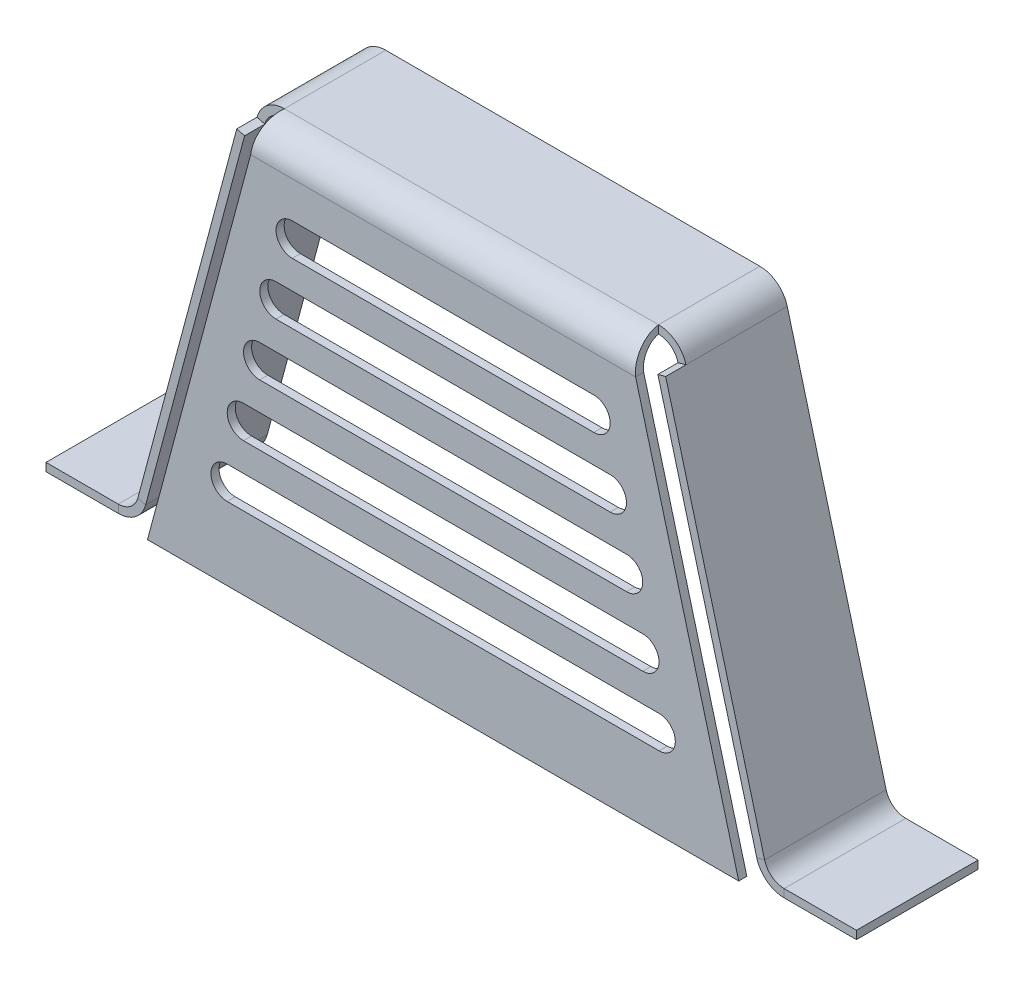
ISO-10303-21;
HEADER;
FILE_DESCRIPTION(('STEP AP214'),'2;1');
FILE_NAME('part.step','',(''),(''),'','','');
FILE_SCHEMA(('AUTOMOTIVE_DESIGN { 1 0 10303 214 1 1 1 1 }'));
ENDSEC;
DATA;
#1=APPLICATION_CONTEXT('core data for automotive mechanical design processes');
#2=APPLICATION_PROTOCOL_DEFINITION('international standard','automotive_design',2000,#1);
#3=PRODUCT_CONTEXT('',#1,'mechanical');
#4=PRODUCT('Part','Part','',(#3));
#5=PRODUCT_RELATED_PRODUCT_CATEGORY('part','',(#4));
#6=PRODUCT_DEFINITION_FORMATION('','',#4);
#7=PRODUCT_DEFINITION_CONTEXT('part definition',#1,'design');
#8=PRODUCT_DEFINITION('design','',#6,#7);
#9=PRODUCT_DEFINITION_SHAPE('','',#8);
#10=(LENGTH_UNIT() NAMED_UNIT(*) SI_UNIT(.MILLI.,.METRE.));
#11=(NAMED_UNIT(*) PLANE_ANGLE_UNIT() SI_UNIT($,.RADIAN.));
#12=(NAMED_UNIT(*) SI_UNIT($,.STERADIAN.) SOLID_ANGLE_UNIT());
#13=UNCERTAINTY_MEASURE_WITH_UNIT(LENGTH_MEASURE(1.E-05),#10,'distance_accuracy_value','');
#14=(GEOMETRIC_REPRESENTATION_CONTEXT(3) GLOBAL_UNCERTAINTY_ASSIGNED_CONTEXT((#13)) GLOBAL_UNIT_ASSIGNED_CONTEXT((#10,
#11,#12)) REPRESENTATION_CONTEXT('',''));
#15=CARTESIAN_POINT('',(0.,0.,0.));
#16=DIRECTION('',(0.,0.,1.));
#17=DIRECTION('',(1.,0.,0.));
#18=AXIS2_PLACEMENT_3D('',#15,#16,#17);
#19=CARTESIAN_POINT('',(20.6576409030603,77.0953654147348,0.));
#20=DIRECTION('',(0.258819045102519,0.965925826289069,0.));
#21=DIRECTION('',(-0.965925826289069,0.258819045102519,0.));
#22=AXIS2_PLACEMENT_3D('',#19,#20,#21);
#23=PLANE('',#22);
#24=DIRECTION('',(0.965925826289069,-0.258819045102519,0.));
#25=VECTOR('',#24,1.);
#26=CARTESIAN_POINT('',(-52.9248458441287,96.8117333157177,25.));
#27=LINE('',#26,#25);
#28=CARTESIAN_POINT('',(-52.9248458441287,96.8117333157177,25.));
#29=VERTEX_POINT('',#28);
#30=CARTESIAN_POINT('',(-50.9929941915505,96.2940952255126,25.));
#31=VERTEX_POINT('',#30);
#32=EDGE_CURVE('E12',#29,#31,#27,.T.);
#33=ORIENTED_EDGE('',*,*,#32,.F.);
#34=DIRECTION('',(0.,0.,-1.));
#35=VECTOR('',#34,1.);
#36=CARTESIAN_POINT('',(-52.9248458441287,96.8117333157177,30.));
#37=LINE('',#36,#35);
#38=CARTESIAN_POINT('',(-52.9248458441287,96.8117333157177,30.));
#39=VERTEX_POINT('',#38);
#40=EDGE_CURVE('E763',#39,#29,#37,.T.);
#41=ORIENTED_EDGE('',*,*,#40,.F.);
#42=DIRECTION('',(-0.965925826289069,0.258819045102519,0.));
#43=VECTOR('',#42,1.);
#44=CARTESIAN_POINT('',(-50.9929941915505,96.2940952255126,30.));
#45=LINE('',#44,#43);
#46=CARTESIAN_POINT('',(-50.9929941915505,96.2940952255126,30.));
#47=VERTEX_POINT('',#46);
#48=EDGE_CURVE('E830',#47,#39,#45,.T.);
#49=ORIENTED_EDGE('',*,*,#48,.F.);
#50=DIRECTION('',(0.,0.,-1.));
#51=VECTOR('',#50,1.);
#52=CARTESIAN_POINT('',(-50.9929941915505,96.2940952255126,30.));
#53=LINE('',#52,#51);
#54=EDGE_CURVE('E766',#47,#31,#53,.T.);
#55=ORIENTED_EDGE('',*,*,#54,.T.);
#56=EDGE_LOOP('',(#33,#41,#49,#55));
#57=FACE_BOUND('',#56,.T.);
#58=ADVANCED_FACE('F40',(#57),#23,.T.);
#59=CARTESIAN_POINT('',(-46.1633650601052,95.,30.));
#60=DIRECTION('',(0.,0.,-1.));
#61=DIRECTION('',(-1.,0.,0.));
#62=AXIS2_PLACEMENT_3D('',#59,#60,#61);
#63=CYLINDRICAL_SURFACE('',#62,7.);
#64=CARTESIAN_POINT('',(-52.9248458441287,96.8117333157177,0.));
#65=VERTEX_POINT('',#64);
#66=EDGE_CURVE('E776',#29,#65,#37,.T.);
#67=ORIENTED_EDGE('',*,*,#66,.F.);
#68=CARTESIAN_POINT('',(-46.1633650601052,95.,25.));
#69=DIRECTION('',(0.,0.,1.));
#70=DIRECTION('',(0.,-1.,0.));
#71=AXIS2_PLACEMENT_3D('',#68,#69,#70);
#72=CIRCLE('',#71,7.);
#73=CARTESIAN_POINT('',(-46.1633650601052,102.,25.));
#74=VERTEX_POINT('',#73);
#75=EDGE_CURVE('E770',#29,#74,#72,.F.);
#76=ORIENTED_EDGE('',*,*,#75,.T.);
#77=DIRECTION('',(0.,0.,-1.));
#78=VECTOR('',#77,1.);
#79=CARTESIAN_POINT('',(-46.1633650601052,102.,30.));
#80=LINE('',#79,#78);
#81=CARTESIAN_POINT('',(-46.1633650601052,102.,0.));
#82=VERTEX_POINT('',#81);
#83=EDGE_CURVE('E787',#74,#82,#80,.T.);
#84=ORIENTED_EDGE('',*,*,#83,.T.);
#85=CARTESIAN_POINT('',(-46.1633650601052,95.,0.));
#86=DIRECTION('',(0.,0.,1.));
#87=DIRECTION('',(1.,0.,0.));
#88=AXIS2_PLACEMENT_3D('',#85,#86,#87);
#89=CIRCLE('',#88,7.);
#90=EDGE_CURVE('E778',#65,#82,#89,.F.);
#91=ORIENTED_EDGE('',*,*,#90,.F.);
#92=EDGE_LOOP('',(#67,#76,#84,#91));
#93=FACE_BOUND('',#92,.T.);
#94=ADVANCED_FACE('F662',(#93),#63,.T.);
#95=CARTESIAN_POINT('',(-20.6576409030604,77.0953654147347,0.));
#96=DIRECTION('',(-0.25881904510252,0.965925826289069,0.));
#97=DIRECTION('',(-0.965925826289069,-0.25881904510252,0.));
#98=AXIS2_PLACEMENT_3D('',#95,#96,#97);
#99=PLANE('',#98);
#100=DIRECTION('',(0.965925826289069,0.25881904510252,0.));
#101=VECTOR('',#100,1.);
#102=CARTESIAN_POINT('',(50.9929941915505,96.2940952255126,25.));
#103=LINE('',#102,#101);
#104=CARTESIAN_POINT('',(50.9929941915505,96.2940952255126,25.));
#105=VERTEX_POINT('',#104);
#106=CARTESIAN_POINT('',(52.9248458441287,96.8117333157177,25.));
#107=VERTEX_POINT('',#106);
#108=EDGE_CURVE('E773',#105,#107,#103,.T.);
#109=ORIENTED_EDGE('',*,*,#108,.F.);
#110=DIRECTION('',(0.,0.,-1.));
#111=VECTOR('',#110,1.);
#112=CARTESIAN_POINT('',(50.9929941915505,96.2940952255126,30.));
#113=LINE('',#112,#111);
#114=CARTESIAN_POINT('',(50.9929941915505,96.2940952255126,30.));
#115=VERTEX_POINT('',#114);
#116=EDGE_CURVE('E863',#115,#105,#113,.T.);
#117=ORIENTED_EDGE('',*,*,#116,.F.);
#118=DIRECTION('',(-0.965925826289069,-0.25881904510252,0.));
#119=VECTOR('',#118,1.);
#120=CARTESIAN_POINT('',(52.9248458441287,96.8117333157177,30.));
#121=LINE('',#120,#119);
#122=CARTESIAN_POINT('',(52.9248458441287,96.8117333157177,30.));
#123=VERTEX_POINT('',#122);
#124=EDGE_CURVE('E822',#123,#115,#121,.T.);
#125=ORIENTED_EDGE('',*,*,#124,.F.);
#126=DIRECTION('',(0.,0.,-1.));
#127=VECTOR('',#126,1.);
#128=CARTESIAN_POINT('',(52.9248458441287,96.8117333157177,30.));
#129=LINE('',#128,#127);
#130=EDGE_CURVE('E795',#123,#107,#129,.T.);
#131=ORIENTED_EDGE('',*,*,#130,.T.);
#132=EDGE_LOOP('',(#109,#117,#125,#131));
#133=FACE_BOUND('',#132,.T.);
#134=ADVANCED_FACE('F665',(#133),#99,.T.);
#135=CARTESIAN_POINT('',(46.1633650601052,95.,30.));
#136=DIRECTION('',(0.,0.,-1.));
#137=DIRECTION('',(-1.,0.,0.));
#138=AXIS2_PLACEMENT_3D('',#135,#136,#137);
#139=CYLINDRICAL_SURFACE('',#138,7.);
#140=DIRECTION('',(0.,0.,-1.));
#141=VECTOR('',#140,1.);
#142=CARTESIAN_POINT('',(46.1633650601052,102.,30.));
#143=LINE('',#142,#141);
#144=CARTESIAN_POINT('',(46.1633650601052,102.,25.));
#145=VERTEX_POINT('',#144);
#146=CARTESIAN_POINT('',(46.1633650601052,102.,0.));
#147=VERTEX_POINT('',#146);
#148=EDGE_CURVE('E788',#145,#147,#143,.T.);
#149=ORIENTED_EDGE('',*,*,#148,.F.);
#150=CARTESIAN_POINT('',(46.1633650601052,95.,25.));
#151=DIRECTION('',(0.,0.,1.));
#152=DIRECTION('',(0.,-1.,0.));
#153=AXIS2_PLACEMENT_3D('',#150,#151,#152);
#154=CIRCLE('',#153,7.);
#155=EDGE_CURVE('E843',#145,#107,#154,.F.);
#156=ORIENTED_EDGE('',*,*,#155,.T.);
#157=CARTESIAN_POINT('',(52.9248458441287,96.8117333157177,0.));
#158=VERTEX_POINT('',#157);
#159=EDGE_CURVE('E794',#107,#158,#129,.T.);
#160=ORIENTED_EDGE('',*,*,#159,.T.);
#161=CARTESIAN_POINT('',(46.1633650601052,95.,0.));
#162=DIRECTION('',(0.,0.,1.));
#163=DIRECTION('',(1.,0.,0.));
#164=AXIS2_PLACEMENT_3D('',#161,#162,#163);
#165=CIRCLE('',#164,7.);
#166=EDGE_CURVE('E940',#147,#158,#165,.F.);
#167=ORIENTED_EDGE('',*,*,#166,.F.);
#168=EDGE_LOOP('',(#149,#156,#160,#167));
#169=FACE_BOUND('',#168,.T.);
#170=ADVANCED_FACE('F671',(#169),#139,.T.);
#171=CARTESIAN_POINT('',(46.1633650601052,95.,25.));
#172=DIRECTION('',(0.,0.,1.));
#173=DIRECTION('',(0.,-1.,0.));
#174=AXIS2_PLACEMENT_3D('',#171,#172,#173);
#175=PLANE('',#174);
#176=CARTESIAN_POINT('',(46.1633650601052,95.,25.));
#177=DIRECTION('',(0.,0.,1.));
#178=DIRECTION('',(0.,-1.,0.));
#179=AXIS2_PLACEMENT_3D('',#176,#177,#178);
#180=CIRCLE('',#179,5.);
#181=CARTESIAN_POINT('',(46.1633650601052,100.,25.));
#182=VERTEX_POINT('',#181);
#183=EDGE_CURVE('E840',#182,#105,#180,.F.);
#184=ORIENTED_EDGE('',*,*,#183,.T.);
#185=ORIENTED_EDGE('',*,*,#108,.T.);
#186=ORIENTED_EDGE('',*,*,#155,.F.);
#187=DIRECTION('',(0.,1.,0.));
#188=VECTOR('',#187,1.);
#189=CARTESIAN_POINT('',(46.1633650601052,100.,25.));
#190=LINE('',#189,#188);
#191=EDGE_CURVE('E537',#182,#145,#190,.T.);
#192=ORIENTED_EDGE('',*,*,#191,.F.);
#193=EDGE_LOOP('',(#184,#185,#186,#192));
#194=FACE_BOUND('',#193,.T.);
#195=ADVANCED_FACE('F669',(#194),#175,.T.);
#196=CARTESIAN_POINT('',(50.,102.,30.));
#197=DIRECTION('',(0.,1.,0.));
#198=DIRECTION('',(0.,0.,1.));
#199=AXIS2_PLACEMENT_3D('',#196,#197,#198);
#200=PLANE('',#199);
#201=ORIENTED_EDGE('',*,*,#83,.F.);
#202=DIRECTION('',(-1.,0.,0.));
#203=VECTOR('',#202,1.);
#204=CARTESIAN_POINT('',(-47.5031110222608,102.,25.));
#205=LINE('',#204,#203);
#206=EDGE_CURVE('E532',#74,#145,#205,.F.);
#207=ORIENTED_EDGE('',*,*,#206,.T.);
#208=ORIENTED_EDGE('',*,*,#148,.T.);
#209=DIRECTION('',(1.,0.,0.));
#210=VECTOR('',#209,1.);
#211=CARTESIAN_POINT('',(50.,102.,0.));
#212=LINE('',#211,#210);
#213=EDGE_CURVE('E967',#82,#147,#212,.T.);
#214=ORIENTED_EDGE('',*,*,#213,.F.);
#215=EDGE_LOOP('',(#201,#207,#208,#214));
#216=FACE_BOUND('',#215,.T.);
#217=ADVANCED_FACE('F628',(#216),#200,.T.);
#218=CARTESIAN_POINT('',(50.,100.,30.));
#219=DIRECTION('',(0.,1.,0.));
#220=DIRECTION('',(0.,0.,1.));
#221=AXIS2_PLACEMENT_3D('',#218,#219,#220);
#222=PLANE('',#221);
#223=DIRECTION('',(-1.,0.,0.));
#224=VECTOR('',#223,1.);
#225=CARTESIAN_POINT('',(-47.5031110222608,100.,25.));
#226=LINE('',#225,#224);
#227=CARTESIAN_POINT('',(-46.1633650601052,100.,25.));
#228=VERTEX_POINT('',#227);
#229=EDGE_CURVE('E529',#228,#182,#226,.F.);
#230=ORIENTED_EDGE('',*,*,#229,.F.);
#231=DIRECTION('',(0.,0.,-1.));
#232=VECTOR('',#231,1.);
#233=CARTESIAN_POINT('',(-46.1633650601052,100.,30.));
#234=LINE('',#233,#232);
#235=CARTESIAN_POINT('',(-46.1633650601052,100.,0.));
#236=VERTEX_POINT('',#235);
#237=EDGE_CURVE('E851',#228,#236,#234,.T.);
#238=ORIENTED_EDGE('',*,*,#237,.T.);
#239=DIRECTION('',(1.,0.,0.));
#240=VECTOR('',#239,1.);
#241=CARTESIAN_POINT('',(50.,100.,0.));
#242=LINE('',#241,#240);
#243=CARTESIAN_POINT('',(46.1633650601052,100.,0.));
#244=VERTEX_POINT('',#243);
#245=EDGE_CURVE('E910',#236,#244,#242,.T.);
#246=ORIENTED_EDGE('',*,*,#245,.T.);
#247=DIRECTION('',(0.,0.,-1.));
#248=VECTOR('',#247,1.);
#249=CARTESIAN_POINT('',(46.1633650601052,100.,30.));
#250=LINE('',#249,#248);
#251=EDGE_CURVE('E853',#182,#244,#250,.T.);
#252=ORIENTED_EDGE('',*,*,#251,.F.);
#253=EDGE_LOOP('',(#230,#238,#246,#252));
#254=FACE_BOUND('',#253,.T.);
#255=ADVANCED_FACE('F624',(#254),#222,.F.);
#256=CARTESIAN_POINT('',(-82.166208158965,0.,30.));
#257=DIRECTION('',(0.,0.,1.));
#258=DIRECTION('',(1.,0.,0.));
#259=AXIS2_PLACEMENT_3D('',#256,#257,#258);
#260=PLANE('',#259);
#261=DIRECTION('',(0.,1.,0.));
#262=VECTOR('',#261,1.);
#263=CARTESIAN_POINT('',(-82.166208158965,0.,30.));
#264=LINE('',#263,#262);
#265=CARTESIAN_POINT('',(-82.166208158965,0.,30.));
#266=VERTEX_POINT('',#265);
#267=CARTESIAN_POINT('',(-82.166208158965,2.,30.));
#268=VERTEX_POINT('',#267);
#269=EDGE_CURVE('E838',#266,#268,#264,.T.);
#270=ORIENTED_EDGE('',*,*,#269,.F.);
#271=CARTESIAN_POINT('',(-82.166208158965,7.,30.));
#272=DIRECTION('',(0.,0.,-1.));
#273=DIRECTION('',(-1.,0.,0.));
#274=AXIS2_PLACEMENT_3D('',#271,#272,#273);
#275=CIRCLE('',#274,7.);
#276=CARTESIAN_POINT('',(-75.4047273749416,5.18826668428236,30.));
#277=VERTEX_POINT('',#276);
#278=EDGE_CURVE('E976',#266,#277,#275,.F.);
#279=ORIENTED_EDGE('',*,*,#278,.T.);
#280=DIRECTION('',(0.965925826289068,-0.25881904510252,0.));
#281=VECTOR('',#280,1.);
#282=CARTESIAN_POINT('',(-77.3365790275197,5.7059047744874,30.));
#283=LINE('',#282,#281);
#284=CARTESIAN_POINT('',(-77.3365790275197,5.7059047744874,30.));
#285=VERTEX_POINT('',#284);
#286=EDGE_CURVE('E836',#285,#277,#283,.T.);
#287=ORIENTED_EDGE('',*,*,#286,.F.);
#288=CARTESIAN_POINT('',(-82.166208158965,7.,30.));
#289=DIRECTION('',(0.,0.,1.));
#290=DIRECTION('',(1.,0.,0.));
#291=AXIS2_PLACEMENT_3D('',#288,#289,#290);
#292=CIRCLE('',#291,5.);
#293=EDGE_CURVE('E888',#268,#285,#292,.T.);
#294=ORIENTED_EDGE('',*,*,#293,.F.);
#295=EDGE_LOOP('',(#270,#279,#287,#294));
#296=FACE_BOUND('',#295,.T.);
#297=ADVANCED_FACE('F627',(#296),#260,.T.);
#298=CARTESIAN_POINT('',(-77.3365790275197,5.7059047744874,30.));
#299=DIRECTION('',(0.,0.,1.));
#300=DIRECTION('',(1.,0.,0.));
#301=AXIS2_PLACEMENT_3D('',#298,#299,#300);
#302=PLANE('',#301);
#303=DIRECTION('',(1.,0.,0.));
#304=VECTOR('',#303,1.);
#305=CARTESIAN_POINT('',(-76.7949192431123,0.,30.));
#306=LINE('',#305,#304);
#307=CARTESIAN_POINT('',(-100.,0.,30.));
#308=VERTEX_POINT('',#307);
#309=EDGE_CURVE('E980',#308,#266,#306,.T.);
#310=ORIENTED_EDGE('',*,*,#309,.T.);
#311=ORIENTED_EDGE('',*,*,#269,.T.);
#312=DIRECTION('',(1.,0.,0.));
#313=VECTOR('',#312,1.);
#314=CARTESIAN_POINT('',(-76.7949192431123,2.,30.));
#315=LINE('',#314,#313);
#316=CARTESIAN_POINT('',(-100.,2.,30.));
#317=VERTEX_POINT('',#316);
#318=EDGE_CURVE('E987',#317,#268,#315,.T.);
#319=ORIENTED_EDGE('',*,*,#318,.F.);
#320=DIRECTION('',(0.,1.,0.));
#321=VECTOR('',#320,1.);
#322=CARTESIAN_POINT('',(-100.,0.,30.));
#323=LINE('',#322,#321);
#324=EDGE_CURVE('E985',#308,#317,#323,.T.);
#325=ORIENTED_EDGE('',*,*,#324,.F.);
#326=EDGE_LOOP('',(#310,#311,#319,#325));
#327=FACE_BOUND('',#326,.T.);
#328=ADVANCED_FACE('F738',(#327),#302,.T.);
#329=CARTESIAN_POINT('',(-75.4047273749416,5.18826668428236,0.));
#330=DIRECTION('',(0.,0.,-1.));
#331=DIRECTION('',(-1.,0.,0.));
#332=AXIS2_PLACEMENT_3D('',#329,#330,#331);
#333=PLANE('',#332);
#334=DIRECTION('',(-0.965925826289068,0.25881904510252,0.));
#335=VECTOR('',#334,1.);
#336=CARTESIAN_POINT('',(-75.4047273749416,5.18826668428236,0.));
#337=LINE('',#336,#335);
#338=CARTESIAN_POINT('',(-75.4047273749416,5.18826668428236,0.));
#339=VERTEX_POINT('',#338);
#340=CARTESIAN_POINT('',(-77.3365790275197,5.7059047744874,0.));
#341=VERTEX_POINT('',#340);
#342=EDGE_CURVE('E834',#339,#341,#337,.T.);
#343=ORIENTED_EDGE('',*,*,#342,.F.);
#344=CARTESIAN_POINT('',(-82.166208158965,7.,0.));
#345=DIRECTION('',(0.,0.,-1.));
#346=DIRECTION('',(-1.,0.,0.));
#347=AXIS2_PLACEMENT_3D('',#344,#345,#346);
#348=CIRCLE('',#347,7.);
#349=CARTESIAN_POINT('',(-82.166208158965,0.,0.));
#350=VERTEX_POINT('',#349);
#351=EDGE_CURVE('E904',#350,#339,#348,.F.);
#352=ORIENTED_EDGE('',*,*,#351,.F.);
#353=DIRECTION('',(0.,-1.,0.));
#354=VECTOR('',#353,1.);
#355=CARTESIAN_POINT('',(-82.166208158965,2.,0.));
#356=LINE('',#355,#354);
#357=CARTESIAN_POINT('',(-82.166208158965,2.,0.));
#358=VERTEX_POINT('',#357);
#359=EDGE_CURVE('E832',#358,#350,#356,.T.);
#360=ORIENTED_EDGE('',*,*,#359,.F.);
#361=CARTESIAN_POINT('',(-82.166208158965,7.,0.));
#362=DIRECTION('',(0.,0.,1.));
#363=DIRECTION('',(1.,0.,0.));
#364=AXIS2_PLACEMENT_3D('',#361,#362,#363);
#365=CIRCLE('',#364,5.);
#366=EDGE_CURVE('E885',#358,#341,#365,.T.);
#367=ORIENTED_EDGE('',*,*,#366,.T.);
#368=EDGE_LOOP('',(#343,#352,#360,#367));
#369=FACE_BOUND('',#368,.T.);
#370=ADVANCED_FACE('F734',(#369),#333,.T.);
#371=CARTESIAN_POINT('',(-82.166208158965,2.,0.));
#372=DIRECTION('',(0.,0.,-1.));
#373=DIRECTION('',(-1.,0.,0.));
#374=AXIS2_PLACEMENT_3D('',#371,#372,#373);
#375=PLANE('',#374);
#376=DIRECTION('',(0.258819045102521,0.965925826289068,0.));
#377=VECTOR('',#376,1.);
#378=CARTESIAN_POINT('',(-50.,100.,0.));
#379=LINE('',#378,#377);
#380=CARTESIAN_POINT('',(-50.9929941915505,96.2940952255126,0.));
#381=VERTEX_POINT('',#380);
#382=EDGE_CURVE('E906',#339,#381,#379,.T.);
#383=ORIENTED_EDGE('',*,*,#382,.F.);
#384=ORIENTED_EDGE('',*,*,#342,.T.);
#385=DIRECTION('',(0.258819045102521,0.965925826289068,0.));
#386=VECTOR('',#385,1.);
#387=CARTESIAN_POINT('',(-51.9318516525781,100.517638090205,0.));
#388=LINE('',#387,#386);
#389=EDGE_CURVE('E889',#341,#65,#388,.T.);
#390=ORIENTED_EDGE('',*,*,#389,.T.);
#391=DIRECTION('',(0.965925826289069,-0.258819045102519,0.));
#392=VECTOR('',#391,1.);
#393=CARTESIAN_POINT('',(-52.9248458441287,96.8117333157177,0.));
#394=LINE('',#393,#392);
#395=EDGE_CURVE('E824',#65,#381,#394,.T.);
#396=ORIENTED_EDGE('',*,*,#395,.T.);
#397=EDGE_LOOP('',(#383,#384,#390,#396));
#398=FACE_BOUND('',#397,.T.);
#399=ADVANCED_FACE('F730',(#398),#375,.T.);
#400=CARTESIAN_POINT('',(-46.1633650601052,102.,30.));
#401=DIRECTION('',(0.,0.,1.));
#402=DIRECTION('',(1.,0.,0.));
#403=AXIS2_PLACEMENT_3D('',#400,#401,#402);
#404=PLANE('',#403);
#405=DIRECTION('',(0.258819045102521,0.965925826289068,0.));
#406=VECTOR('',#405,1.);
#407=CARTESIAN_POINT('',(-50.,100.,30.));
#408=LINE('',#407,#406);
#409=EDGE_CURVE('E973',#277,#47,#408,.T.);
#410=ORIENTED_EDGE('',*,*,#409,.T.);
#411=ORIENTED_EDGE('',*,*,#48,.T.);
#412=DIRECTION('',(0.258819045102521,0.965925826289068,0.));
#413=VECTOR('',#412,1.);
#414=CARTESIAN_POINT('',(-51.9318516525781,100.517638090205,30.));
#415=LINE('',#414,#413);
#416=EDGE_CURVE('E786',#285,#39,#415,.T.);
#417=ORIENTED_EDGE('',*,*,#416,.F.);
#418=ORIENTED_EDGE('',*,*,#286,.T.);
#419=EDGE_LOOP('',(#410,#411,#417,#418));
#420=FACE_BOUND('',#419,.T.);
#421=ADVANCED_FACE('F726',(#420),#404,.T.);
#422=CARTESIAN_POINT('',(-46.1633650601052,100.,0.));
#423=DIRECTION('',(0.,0.,-1.));
#424=DIRECTION('',(-1.,0.,0.));
#425=AXIS2_PLACEMENT_3D('',#422,#423,#424);
#426=PLANE('',#425);
#427=DIRECTION('',(0.,1.,0.));
#428=VECTOR('',#427,1.);
#429=CARTESIAN_POINT('',(-46.1633650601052,100.,0.));
#430=LINE('',#429,#428);
#431=EDGE_CURVE('E827',#236,#82,#430,.T.);
#432=ORIENTED_EDGE('',*,*,#431,.F.);
#433=CARTESIAN_POINT('',(-46.1633650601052,95.,0.));
#434=DIRECTION('',(0.,0.,1.));
#435=DIRECTION('',(1.,0.,0.));
#436=AXIS2_PLACEMENT_3D('',#433,#434,#435);
#437=CIRCLE('',#436,5.);
#438=EDGE_CURVE('E858',#381,#236,#437,.F.);
#439=ORIENTED_EDGE('',*,*,#438,.F.);
#440=ORIENTED_EDGE('',*,*,#395,.F.);
#441=ORIENTED_EDGE('',*,*,#90,.T.);
#442=EDGE_LOOP('',(#432,#439,#440,#441));
#443=FACE_BOUND('',#442,.T.);
#444=ADVANCED_FACE('F722',(#443),#426,.T.);
#445=CARTESIAN_POINT('',(-52.9248458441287,96.8117333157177,0.));
#446=DIRECTION('',(0.,0.,-1.));
#447=DIRECTION('',(-1.,0.,0.));
#448=AXIS2_PLACEMENT_3D('',#445,#446,#447);
#449=PLANE('',#448);
#450=ORIENTED_EDGE('',*,*,#245,.F.);
#451=ORIENTED_EDGE('',*,*,#431,.T.);
#452=ORIENTED_EDGE('',*,*,#213,.T.);
#453=DIRECTION('',(0.,-1.,0.));
#454=VECTOR('',#453,1.);
#455=CARTESIAN_POINT('',(46.1633650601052,102.,0.));
#456=LINE('',#455,#454);
#457=EDGE_CURVE('E816',#147,#244,#456,.T.);
#458=ORIENTED_EDGE('',*,*,#457,.T.);
#459=EDGE_LOOP('',(#450,#451,#452,#458));
#460=FACE_BOUND('',#459,.T.);
#461=ADVANCED_FACE('F718',(#460),#449,.T.);
#462=CARTESIAN_POINT('',(50.9929941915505,96.2940952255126,0.));
#463=DIRECTION('',(0.,0.,-1.));
#464=DIRECTION('',(-1.,0.,0.));
#465=AXIS2_PLACEMENT_3D('',#462,#463,#464);
#466=PLANE('',#465);
#467=DIRECTION('',(0.965925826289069,0.25881904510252,0.));
#468=VECTOR('',#467,1.);
#469=CARTESIAN_POINT('',(50.9929941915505,96.2940952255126,0.));
#470=LINE('',#469,#468);
#471=CARTESIAN_POINT('',(50.9929941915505,96.2940952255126,0.));
#472=VERTEX_POINT('',#471);
#473=EDGE_CURVE('E819',#472,#158,#470,.T.);
#474=ORIENTED_EDGE('',*,*,#473,.F.);
#475=CARTESIAN_POINT('',(46.1633650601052,95.,0.));
#476=DIRECTION('',(0.,0.,1.));
#477=DIRECTION('',(1.,0.,0.));
#478=AXIS2_PLACEMENT_3D('',#475,#476,#477);
#479=CIRCLE('',#478,5.);
#480=EDGE_CURVE('E912',#244,#472,#479,.F.);
#481=ORIENTED_EDGE('',*,*,#480,.F.);
#482=ORIENTED_EDGE('',*,*,#457,.F.);
#483=ORIENTED_EDGE('',*,*,#166,.T.);
#484=EDGE_LOOP('',(#474,#481,#482,#483));
#485=FACE_BOUND('',#484,.T.);
#486=ADVANCED_FACE('F714',(#485),#466,.T.);
#487=CARTESIAN_POINT('',(46.1633650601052,102.,0.));
#488=DIRECTION('',(0.,0.,-1.));
#489=DIRECTION('',(-1.,0.,0.));
#490=AXIS2_PLACEMENT_3D('',#487,#488,#489);
#491=PLANE('',#490);
#492=DIRECTION('',(0.258819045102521,-0.965925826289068,0.));
#493=VECTOR('',#492,1.);
#494=CARTESIAN_POINT('',(50.,100.,0.));
#495=LINE('',#494,#493);
#496=CARTESIAN_POINT('',(75.4047273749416,5.18826668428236,0.));
#497=VERTEX_POINT('',#496);
#498=EDGE_CURVE('E915',#472,#497,#495,.T.);
#499=ORIENTED_EDGE('',*,*,#498,.F.);
#500=ORIENTED_EDGE('',*,*,#473,.T.);
#501=DIRECTION('',(0.258819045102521,-0.965925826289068,0.));
#502=VECTOR('',#501,1.);
#503=CARTESIAN_POINT('',(51.9318516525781,100.517638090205,0.));
#504=LINE('',#503,#502);
#505=CARTESIAN_POINT('',(77.3365790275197,5.7059047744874,0.));
#506=VERTEX_POINT('',#505);
#507=EDGE_CURVE('E943',#158,#506,#504,.T.);
#508=ORIENTED_EDGE('',*,*,#507,.T.);
#509=DIRECTION('',(-0.965925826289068,-0.258819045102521,0.));
#510=VECTOR('',#509,1.);
#511=CARTESIAN_POINT('',(77.3365790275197,5.7059047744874,0.));
#512=LINE('',#511,#510);
#513=EDGE_CURVE('E808',#506,#497,#512,.T.);
#514=ORIENTED_EDGE('',*,*,#513,.T.);
#515=EDGE_LOOP('',(#499,#500,#508,#514));
#516=FACE_BOUND('',#515,.T.);
#517=ADVANCED_FACE('F710',(#516),#491,.T.);
#518=CARTESIAN_POINT('',(75.4047273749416,5.18826668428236,30.));
#519=DIRECTION('',(0.,0.,1.));
#520=DIRECTION('',(1.,0.,0.));
#521=AXIS2_PLACEMENT_3D('',#518,#519,#520);
#522=PLANE('',#521);
#523=DIRECTION('',(0.965925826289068,0.258819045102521,0.));
#524=VECTOR('',#523,1.);
#525=CARTESIAN_POINT('',(75.4047273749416,5.18826668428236,30.));
#526=LINE('',#525,#524);
#527=CARTESIAN_POINT('',(75.4047273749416,5.18826668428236,30.));
#528=VERTEX_POINT('',#527);
#529=CARTESIAN_POINT('',(77.3365790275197,5.7059047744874,30.));
#530=VERTEX_POINT('',#529);
#531=EDGE_CURVE('E814',#528,#530,#526,.T.);
#532=ORIENTED_EDGE('',*,*,#531,.F.);
#533=CARTESIAN_POINT('',(82.166208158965,7.,30.));
#534=DIRECTION('',(0.,0.,-1.));
#535=DIRECTION('',(-1.,0.,0.));
#536=AXIS2_PLACEMENT_3D('',#533,#534,#535);
#537=CIRCLE('',#536,7.);
#538=CARTESIAN_POINT('',(82.166208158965,0.,30.));
#539=VERTEX_POINT('',#538);
#540=EDGE_CURVE('E925',#528,#539,#537,.F.);
#541=ORIENTED_EDGE('',*,*,#540,.T.);
#542=DIRECTION('',(0.,-1.,0.));
#543=VECTOR('',#542,1.);
#544=CARTESIAN_POINT('',(82.166208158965,2.,30.));
#545=LINE('',#544,#543);
#546=CARTESIAN_POINT('',(82.166208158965,2.,30.));
#547=VERTEX_POINT('',#546);
#548=EDGE_CURVE('E812',#547,#539,#545,.T.);
#549=ORIENTED_EDGE('',*,*,#548,.F.);
#550=CARTESIAN_POINT('',(82.166208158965,7.,30.));
#551=DIRECTION('',(0.,0.,1.));
#552=DIRECTION('',(1.,0.,0.));
#553=AXIS2_PLACEMENT_3D('',#550,#551,#552);
#554=CIRCLE('',#553,5.);
#555=EDGE_CURVE('E1700',#530,#547,#554,.T.);
#556=ORIENTED_EDGE('',*,*,#555,.F.);
#557=EDGE_LOOP('',(#532,#541,#549,#556));
#558=FACE_BOUND('',#557,.T.);
#559=ADVANCED_FACE('F706',(#558),#522,.T.);
#560=CARTESIAN_POINT('',(82.166208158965,2.,30.));
#561=DIRECTION('',(0.,0.,1.));
#562=DIRECTION('',(1.,0.,0.));
#563=AXIS2_PLACEMENT_3D('',#560,#561,#562);
#564=PLANE('',#563);
#565=DIRECTION('',(0.258819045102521,-0.965925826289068,0.));
#566=VECTOR('',#565,1.);
#567=CARTESIAN_POINT('',(50.,100.,30.));
#568=LINE('',#567,#566);
#569=EDGE_CURVE('E996',#115,#528,#568,.T.);
#570=ORIENTED_EDGE('',*,*,#569,.T.);
#571=ORIENTED_EDGE('',*,*,#531,.T.);
#572=DIRECTION('',(0.258819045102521,-0.965925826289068,0.));
#573=VECTOR('',#572,1.);
#574=CARTESIAN_POINT('',(51.9318516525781,100.517638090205,30.));
#575=LINE('',#574,#573);
#576=EDGE_CURVE('E953',#123,#530,#575,.T.);
#577=ORIENTED_EDGE('',*,*,#576,.F.);
#578=ORIENTED_EDGE('',*,*,#124,.T.);
#579=EDGE_LOOP('',(#570,#571,#577,#578));
#580=FACE_BOUND('',#579,.T.);
#581=ADVANCED_FACE('F702',(#580),#564,.T.);
#582=CARTESIAN_POINT('',(82.166208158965,0.,0.));
#583=DIRECTION('',(0.,0.,-1.));
#584=DIRECTION('',(-1.,0.,0.));
#585=AXIS2_PLACEMENT_3D('',#582,#583,#584);
#586=PLANE('',#585);
#587=DIRECTION('',(0.,1.,0.));
#588=VECTOR('',#587,1.);
#589=CARTESIAN_POINT('',(82.166208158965,0.,0.));
#590=LINE('',#589,#588);
#591=CARTESIAN_POINT('',(82.166208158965,0.,0.));
#592=VERTEX_POINT('',#591);
#593=CARTESIAN_POINT('',(82.166208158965,2.,0.));
#594=VERTEX_POINT('',#593);
#595=EDGE_CURVE('E810',#592,#594,#590,.T.);
#596=ORIENTED_EDGE('',*,*,#595,.F.);
#597=CARTESIAN_POINT('',(82.166208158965,7.,0.));
#598=DIRECTION('',(0.,0.,-1.));
#599=DIRECTION('',(-1.,0.,0.));
#600=AXIS2_PLACEMENT_3D('',#597,#598,#599);
#601=CIRCLE('',#600,7.);
#602=EDGE_CURVE('E918',#497,#592,#601,.F.);
#603=ORIENTED_EDGE('',*,*,#602,.F.);
#604=ORIENTED_EDGE('',*,*,#513,.F.);
#605=CARTESIAN_POINT('',(82.166208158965,7.,0.));
#606=DIRECTION('',(0.,0.,1.));
#607=DIRECTION('',(1.,0.,0.));
#608=AXIS2_PLACEMENT_3D('',#605,#606,#607);
#609=CIRCLE('',#608,5.);
#610=EDGE_CURVE('E947',#506,#594,#609,.T.);
#611=ORIENTED_EDGE('',*,*,#610,.T.);
#612=EDGE_LOOP('',(#596,#603,#604,#611));
#613=FACE_BOUND('',#612,.T.);
#614=ADVANCED_FACE('F698',(#613),#586,.T.);
#615=CARTESIAN_POINT('',(77.3365790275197,5.7059047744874,0.));
#616=DIRECTION('',(0.,0.,-1.));
#617=DIRECTION('',(-1.,0.,0.));
#618=AXIS2_PLACEMENT_3D('',#615,#616,#617);
#619=PLANE('',#618);
#620=DIRECTION('',(1.,0.,0.));
#621=VECTOR('',#620,1.);
#622=CARTESIAN_POINT('',(76.7949192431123,0.,0.));
#623=LINE('',#622,#621);
#624=CARTESIAN_POINT('',(100.,0.,0.));
#625=VERTEX_POINT('',#624);
#626=EDGE_CURVE('E540',#592,#625,#623,.T.);
#627=ORIENTED_EDGE('',*,*,#626,.F.);
#628=ORIENTED_EDGE('',*,*,#595,.T.);
#629=DIRECTION('',(1.,0.,0.));
#630=VECTOR('',#629,1.);
#631=CARTESIAN_POINT('',(76.7949192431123,2.,0.));
#632=LINE('',#631,#630);
#633=CARTESIAN_POINT('',(100.,2.,0.));
#634=VERTEX_POINT('',#633);
#635=EDGE_CURVE('E958',#594,#634,#632,.T.);
#636=ORIENTED_EDGE('',*,*,#635,.T.);
#637=DIRECTION('',(0.,-1.,0.));
#638=VECTOR('',#637,1.);
#639=CARTESIAN_POINT('',(100.,2.,0.));
#640=LINE('',#639,#638);
#641=EDGE_CURVE('E962',#634,#625,#640,.T.);
#642=ORIENTED_EDGE('',*,*,#641,.T.);
#643=EDGE_LOOP('',(#627,#628,#636,#642));
#644=FACE_BOUND('',#643,.T.);
#645=ADVANCED_FACE('F694',(#644),#619,.T.);
#646=CARTESIAN_POINT('',(76.7949192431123,0.,30.));
#647=DIRECTION('',(0.,1.,0.));
#648=DIRECTION('',(-1.,0.,0.));
#649=AXIS2_PLACEMENT_3D('',#646,#647,#648);
#650=PLANE('',#649);
#651=ORIENTED_EDGE('',*,*,#626,.T.);
#652=DIRECTION('',(0.,0.,-1.));
#653=VECTOR('',#652,1.);
#654=CARTESIAN_POINT('',(100.,0.,30.));
#655=LINE('',#654,#653);
#656=CARTESIAN_POINT('',(100.,0.,30.));
#657=VERTEX_POINT('',#656);
#658=EDGE_CURVE('E806',#657,#625,#655,.T.);
#659=ORIENTED_EDGE('',*,*,#658,.F.);
#660=DIRECTION('',(1.,0.,0.));
#661=VECTOR('',#660,1.);
#662=CARTESIAN_POINT('',(76.7949192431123,0.,30.));
#663=LINE('',#662,#661);
#664=EDGE_CURVE('E589',#539,#657,#663,.T.);
#665=ORIENTED_EDGE('',*,*,#664,.F.);
#666=DIRECTION('',(0.,0.,-1.));
#667=VECTOR('',#666,1.);
#668=CARTESIAN_POINT('',(82.166208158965,0.,30.));
#669=LINE('',#668,#667);
#670=EDGE_CURVE('E921',#539,#592,#669,.T.);
#671=ORIENTED_EDGE('',*,*,#670,.T.);
#672=EDGE_LOOP('',(#651,#659,#665,#671));
#673=FACE_BOUND('',#672,.T.);
#674=ADVANCED_FACE('F690',(#673),#650,.F.);
#675=CARTESIAN_POINT('',(100.,2.,30.));
#676=DIRECTION('',(1.,0.,0.));
#677=DIRECTION('',(0.,0.,-1.));
#678=AXIS2_PLACEMENT_3D('',#675,#676,#677);
#679=PLANE('',#678);
#680=ORIENTED_EDGE('',*,*,#641,.F.);
#681=DIRECTION('',(0.,0.,-1.));
#682=VECTOR('',#681,1.);
#683=CARTESIAN_POINT('',(100.,2.,30.));
#684=LINE('',#683,#682);
#685=CARTESIAN_POINT('',(100.,2.,30.));
#686=VERTEX_POINT('',#685);
#687=EDGE_CURVE('E804',#686,#634,#684,.T.);
#688=ORIENTED_EDGE('',*,*,#687,.F.);
#689=DIRECTION('',(0.,-1.,0.));
#690=VECTOR('',#689,1.);
#691=CARTESIAN_POINT('',(100.,2.,30.));
#692=LINE('',#691,#690);
#693=EDGE_CURVE('E1008',#686,#657,#692,.T.);
#694=ORIENTED_EDGE('',*,*,#693,.T.);
#695=ORIENTED_EDGE('',*,*,#658,.T.);
#696=EDGE_LOOP('',(#680,#688,#694,#695));
#697=FACE_BOUND('',#696,.T.);
#698=ADVANCED_FACE('F686',(#697),#679,.T.);
#699=CARTESIAN_POINT('',(76.7949192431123,2.,30.));
#700=DIRECTION('',(0.,1.,0.));
#701=DIRECTION('',(-1.,0.,0.));
#702=AXIS2_PLACEMENT_3D('',#699,#700,#701);
#703=PLANE('',#702);
#704=ORIENTED_EDGE('',*,*,#635,.F.);
#705=DIRECTION('',(0.,0.,-1.));
#706=VECTOR('',#705,1.);
#707=CARTESIAN_POINT('',(82.166208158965,2.,30.));
#708=LINE('',#707,#706);
#709=EDGE_CURVE('E801',#547,#594,#708,.T.);
#710=ORIENTED_EDGE('',*,*,#709,.F.);
#711=DIRECTION('',(1.,0.,0.));
#712=VECTOR('',#711,1.);
#713=CARTESIAN_POINT('',(76.7949192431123,2.,30.));
#714=LINE('',#713,#712);
#715=EDGE_CURVE('E1702',#547,#686,#714,.T.);
#716=ORIENTED_EDGE('',*,*,#715,.T.);
#717=ORIENTED_EDGE('',*,*,#687,.T.);
#718=EDGE_LOOP('',(#704,#710,#716,#717));
#719=FACE_BOUND('',#718,.T.);
#720=ADVANCED_FACE('F682',(#719),#703,.T.);
#721=CARTESIAN_POINT('',(82.166208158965,7.,30.));
#722=DIRECTION('',(0.,0.,-1.));
#723=DIRECTION('',(-1.,0.,0.));
#724=AXIS2_PLACEMENT_3D('',#721,#722,#723);
#725=CYLINDRICAL_SURFACE('',#724,5.);
#726=ORIENTED_EDGE('',*,*,#610,.F.);
#727=DIRECTION('',(0.,0.,-1.));
#728=VECTOR('',#727,1.);
#729=CARTESIAN_POINT('',(77.3365790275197,5.7059047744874,30.));
#730=LINE('',#729,#728);
#731=EDGE_CURVE('E798',#530,#506,#730,.T.);
#732=ORIENTED_EDGE('',*,*,#731,.F.);
#733=ORIENTED_EDGE('',*,*,#555,.T.);
#734=ORIENTED_EDGE('',*,*,#709,.T.);
#735=EDGE_LOOP('',(#726,#732,#733,#734));
#736=FACE_BOUND('',#735,.T.);
#737=ADVANCED_FACE('F678',(#736),#725,.F.);
#738=CARTESIAN_POINT('',(51.9318516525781,100.517638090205,30.));
#739=DIRECTION('',(0.965925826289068,0.258819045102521,0.));
#740=DIRECTION('',(-0.258819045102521,0.965925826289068,0.));
#741=AXIS2_PLACEMENT_3D('',#738,#739,#740);
#742=PLANE('',#741);
#743=ORIENTED_EDGE('',*,*,#507,.F.);
#744=ORIENTED_EDGE('',*,*,#159,.F.);
#745=ORIENTED_EDGE('',*,*,#130,.F.);
#746=ORIENTED_EDGE('',*,*,#576,.T.);
#747=ORIENTED_EDGE('',*,*,#731,.T.);
#748=EDGE_LOOP('',(#743,#744,#745,#746,#747));
#749=FACE_BOUND('',#748,.T.);
#750=ADVANCED_FACE('F675',(#749),#742,.T.);
#751=CARTESIAN_POINT('',(-46.1633650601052,95.,25.));
#752=DIRECTION('',(0.,0.,1.));
#753=DIRECTION('',(0.,-1.,0.));
#754=AXIS2_PLACEMENT_3D('',#751,#752,#753);
#755=PLANE('',#754);
#756=ORIENTED_EDGE('',*,*,#75,.F.);
#757=ORIENTED_EDGE('',*,*,#32,.T.);
#758=CARTESIAN_POINT('',(-46.1633650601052,95.,25.));
#759=DIRECTION('',(0.,0.,1.));
#760=DIRECTION('',(0.,-1.,0.));
#761=AXIS2_PLACEMENT_3D('',#758,#759,#760);
#762=CIRCLE('',#761,5.);
#763=EDGE_CURVE('E47',#31,#228,#762,.F.);
#764=ORIENTED_EDGE('',*,*,#763,.T.);
#765=DIRECTION('',(0.,1.,0.));
#766=VECTOR('',#765,1.);
#767=CARTESIAN_POINT('',(-46.1633650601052,100.,25.));
#768=LINE('',#767,#766);
#769=EDGE_CURVE('E541',#228,#74,#768,.T.);
#770=ORIENTED_EDGE('',*,*,#769,.T.);
#771=EDGE_LOOP('',(#756,#757,#764,#770));
#772=FACE_BOUND('',#771,.T.);
#773=ADVANCED_FACE('F660',(#772),#755,.T.);
#774=CARTESIAN_POINT('',(-51.9318516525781,100.517638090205,30.));
#775=DIRECTION('',(-0.965925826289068,0.258819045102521,0.));
#776=DIRECTION('',(-0.258819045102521,-0.965925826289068,0.));
#777=AXIS2_PLACEMENT_3D('',#774,#775,#776);
#778=PLANE('',#777);
#779=ORIENTED_EDGE('',*,*,#389,.F.);
#780=DIRECTION('',(0.,0.,-1.));
#781=VECTOR('',#780,1.);
#782=CARTESIAN_POINT('',(-77.3365790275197,5.7059047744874,30.));
#783=LINE('',#782,#781);
#784=EDGE_CURVE('E782',#285,#341,#783,.T.);
#785=ORIENTED_EDGE('',*,*,#784,.F.);
#786=ORIENTED_EDGE('',*,*,#416,.T.);
#787=ORIENTED_EDGE('',*,*,#40,.T.);
#788=ORIENTED_EDGE('',*,*,#66,.T.);
#789=EDGE_LOOP('',(#779,#785,#786,#787,#788));
#790=FACE_BOUND('',#789,.T.);
#791=ADVANCED_FACE('F656',(#790),#778,.T.);
#792=CARTESIAN_POINT('',(-82.166208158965,7.,30.));
#793=DIRECTION('',(0.,0.,-1.));
#794=DIRECTION('',(-1.,0.,0.));
#795=AXIS2_PLACEMENT_3D('',#792,#793,#794);
#796=CYLINDRICAL_SURFACE('',#795,5.);
#797=ORIENTED_EDGE('',*,*,#366,.F.);
#798=DIRECTION('',(0.,0.,-1.));
#799=VECTOR('',#798,1.);
#800=CARTESIAN_POINT('',(-82.166208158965,2.,30.));
#801=LINE('',#800,#799);
#802=EDGE_CURVE('E876',#268,#358,#801,.T.);
#803=ORIENTED_EDGE('',*,*,#802,.F.);
#804=ORIENTED_EDGE('',*,*,#293,.T.);
#805=ORIENTED_EDGE('',*,*,#784,.T.);
#806=EDGE_LOOP('',(#797,#803,#804,#805));
#807=FACE_BOUND('',#806,.T.);
#808=ADVANCED_FACE('F652',(#807),#796,.F.);
#809=CARTESIAN_POINT('',(-76.7949192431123,2.,30.));
#810=DIRECTION('',(0.,1.,0.));
#811=DIRECTION('',(-1.,0.,0.));
#812=AXIS2_PLACEMENT_3D('',#809,#810,#811);
#813=PLANE('',#812);
#814=DIRECTION('',(1.,0.,0.));
#815=VECTOR('',#814,1.);
#816=CARTESIAN_POINT('',(-76.7949192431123,2.,0.));
#817=LINE('',#816,#815);
#818=CARTESIAN_POINT('',(-100.,2.,0.));
#819=VERTEX_POINT('',#818);
#820=EDGE_CURVE('E893',#819,#358,#817,.T.);
#821=ORIENTED_EDGE('',*,*,#820,.F.);
#822=DIRECTION('',(0.,0.,-1.));
#823=VECTOR('',#822,1.);
#824=CARTESIAN_POINT('',(-100.,2.,30.));
#825=LINE('',#824,#823);
#826=EDGE_CURVE('E875',#317,#819,#825,.T.);
#827=ORIENTED_EDGE('',*,*,#826,.F.);
#828=ORIENTED_EDGE('',*,*,#318,.T.);
#829=ORIENTED_EDGE('',*,*,#802,.T.);
#830=EDGE_LOOP('',(#821,#827,#828,#829));
#831=FACE_BOUND('',#830,.T.);
#832=ADVANCED_FACE('F648',(#831),#813,.T.);
#833=CARTESIAN_POINT('',(-100.,0.,30.));
#834=DIRECTION('',(-1.,0.,0.));
#835=DIRECTION('',(0.,0.,1.));
#836=AXIS2_PLACEMENT_3D('',#833,#834,#835);
#837=PLANE('',#836);
#838=DIRECTION('',(0.,1.,0.));
#839=VECTOR('',#838,1.);
#840=CARTESIAN_POINT('',(-100.,0.,0.));
#841=LINE('',#840,#839);
#842=CARTESIAN_POINT('',(-100.,0.,0.));
#843=VERTEX_POINT('',#842);
#844=EDGE_CURVE('E895',#843,#819,#841,.T.);
#845=ORIENTED_EDGE('',*,*,#844,.F.);
#846=DIRECTION('',(0.,0.,-1.));
#847=VECTOR('',#846,1.);
#848=CARTESIAN_POINT('',(-100.,0.,30.));
#849=LINE('',#848,#847);
#850=EDGE_CURVE('E873',#308,#843,#849,.T.);
#851=ORIENTED_EDGE('',*,*,#850,.F.);
#852=ORIENTED_EDGE('',*,*,#324,.T.);
#853=ORIENTED_EDGE('',*,*,#826,.T.);
#854=EDGE_LOOP('',(#845,#851,#852,#853));
#855=FACE_BOUND('',#854,.T.);
#856=ADVANCED_FACE('F644',(#855),#837,.T.);
#857=CARTESIAN_POINT('',(-76.7949192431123,0.,30.));
#858=DIRECTION('',(0.,1.,0.));
#859=DIRECTION('',(-1.,0.,0.));
#860=AXIS2_PLACEMENT_3D('',#857,#858,#859);
#861=PLANE('',#860);
#862=DIRECTION('',(1.,0.,0.));
#863=VECTOR('',#862,1.);
#864=CARTESIAN_POINT('',(-76.7949192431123,0.,0.));
#865=LINE('',#864,#863);
#866=EDGE_CURVE('E901',#843,#350,#865,.T.);
#867=ORIENTED_EDGE('',*,*,#866,.T.);
#868=DIRECTION('',(0.,0.,-1.));
#869=VECTOR('',#868,1.);
#870=CARTESIAN_POINT('',(-82.166208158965,0.,30.));
#871=LINE('',#870,#869);
#872=EDGE_CURVE('E870',#266,#350,#871,.T.);
#873=ORIENTED_EDGE('',*,*,#872,.F.);
#874=ORIENTED_EDGE('',*,*,#309,.F.);
#875=ORIENTED_EDGE('',*,*,#850,.T.);
#876=EDGE_LOOP('',(#867,#873,#874,#875));
#877=FACE_BOUND('',#876,.T.);
#878=ADVANCED_FACE('F640',(#877),#861,.F.);
#879=CARTESIAN_POINT('',(-82.166208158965,7.,30.));
#880=DIRECTION('',(0.,0.,-1.));
#881=DIRECTION('',(-1.,0.,0.));
#882=AXIS2_PLACEMENT_3D('',#879,#880,#881);
#883=CYLINDRICAL_SURFACE('',#882,7.);
#884=ORIENTED_EDGE('',*,*,#351,.T.);
#885=DIRECTION('',(0.,0.,-1.));
#886=VECTOR('',#885,1.);
#887=CARTESIAN_POINT('',(-75.4047273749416,5.18826668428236,30.));
#888=LINE('',#887,#886);
#889=EDGE_CURVE('E867',#277,#339,#888,.T.);
#890=ORIENTED_EDGE('',*,*,#889,.F.);
#891=ORIENTED_EDGE('',*,*,#278,.F.);
#892=ORIENTED_EDGE('',*,*,#872,.T.);
#893=EDGE_LOOP('',(#884,#890,#891,#892));
#894=FACE_BOUND('',#893,.T.);
#895=ADVANCED_FACE('F636',(#894),#883,.T.);
#896=CARTESIAN_POINT('',(-50.,100.,30.));
#897=DIRECTION('',(-0.965925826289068,0.258819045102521,0.));
#898=DIRECTION('',(-0.258819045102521,-0.965925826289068,0.));
#899=AXIS2_PLACEMENT_3D('',#896,#897,#898);
#900=PLANE('',#899);
#901=ORIENTED_EDGE('',*,*,#382,.T.);
#902=EDGE_CURVE('E860',#31,#381,#53,.T.);
#903=ORIENTED_EDGE('',*,*,#902,.F.);
#904=ORIENTED_EDGE('',*,*,#54,.F.);
#905=ORIENTED_EDGE('',*,*,#409,.F.);
#906=ORIENTED_EDGE('',*,*,#889,.T.);
#907=EDGE_LOOP('',(#901,#903,#904,#905,#906));
#908=FACE_BOUND('',#907,.T.);
#909=ADVANCED_FACE('F632',(#908),#900,.F.);
#910=CARTESIAN_POINT('',(-46.1633650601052,95.,30.));
#911=DIRECTION('',(0.,0.,-1.));
#912=DIRECTION('',(-1.,0.,0.));
#913=AXIS2_PLACEMENT_3D('',#910,#911,#912);
#914=CYLINDRICAL_SURFACE('',#913,5.);
#915=ORIENTED_EDGE('',*,*,#763,.F.);
#916=ORIENTED_EDGE('',*,*,#902,.T.);
#917=ORIENTED_EDGE('',*,*,#438,.T.);
#918=ORIENTED_EDGE('',*,*,#237,.F.);
#919=EDGE_LOOP('',(#915,#916,#917,#918));
#920=FACE_BOUND('',#919,.T.);
#921=ADVANCED_FACE('F622',(#920),#914,.F.);
#922=CARTESIAN_POINT('',(46.1633650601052,95.,30.));
#923=DIRECTION('',(0.,0.,-1.));
#924=DIRECTION('',(-1.,0.,0.));
#925=AXIS2_PLACEMENT_3D('',#922,#923,#924);
#926=CYLINDRICAL_SURFACE('',#925,5.);
#927=ORIENTED_EDGE('',*,*,#183,.F.);
#928=ORIENTED_EDGE('',*,*,#251,.T.);
#929=ORIENTED_EDGE('',*,*,#480,.T.);
#930=EDGE_CURVE('E927',#105,#472,#113,.T.);
#931=ORIENTED_EDGE('',*,*,#930,.F.);
#932=EDGE_LOOP('',(#927,#928,#929,#931));
#933=FACE_BOUND('',#932,.T.);
#934=ADVANCED_FACE('F618',(#933),#926,.F.);
#935=CARTESIAN_POINT('',(50.,100.,30.));
#936=DIRECTION('',(0.965925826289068,0.258819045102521,0.));
#937=DIRECTION('',(-0.258819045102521,0.965925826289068,0.));
#938=AXIS2_PLACEMENT_3D('',#935,#936,#937);
#939=PLANE('',#938);
#940=ORIENTED_EDGE('',*,*,#498,.T.);
#941=DIRECTION('',(0.,0.,-1.));
#942=VECTOR('',#941,1.);
#943=CARTESIAN_POINT('',(75.4047273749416,5.18826668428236,30.));
#944=LINE('',#943,#942);
#945=EDGE_CURVE('E924',#528,#497,#944,.T.);
#946=ORIENTED_EDGE('',*,*,#945,.F.);
#947=ORIENTED_EDGE('',*,*,#569,.F.);
#948=ORIENTED_EDGE('',*,*,#116,.T.);
#949=ORIENTED_EDGE('',*,*,#930,.T.);
#950=EDGE_LOOP('',(#940,#946,#947,#948,#949));
#951=FACE_BOUND('',#950,.T.);
#952=ADVANCED_FACE('F614',(#951),#939,.F.);
#953=CARTESIAN_POINT('',(82.166208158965,7.,30.));
#954=DIRECTION('',(0.,0.,-1.));
#955=DIRECTION('',(-1.,0.,0.));
#956=AXIS2_PLACEMENT_3D('',#953,#954,#955);
#957=CYLINDRICAL_SURFACE('',#956,7.);
#958=ORIENTED_EDGE('',*,*,#602,.T.);
#959=ORIENTED_EDGE('',*,*,#670,.F.);
#960=ORIENTED_EDGE('',*,*,#540,.F.);
#961=ORIENTED_EDGE('',*,*,#945,.T.);
#962=EDGE_LOOP('',(#958,#959,#960,#961));
#963=FACE_BOUND('',#962,.T.);
#964=ADVANCED_FACE('F607',(#963),#957,.T.);
#965=CARTESIAN_POINT('',(82.166208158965,7.,30.));
#966=DIRECTION('',(0.,0.,1.));
#967=DIRECTION('',(1.,0.,0.));
#968=AXIS2_PLACEMENT_3D('',#965,#966,#967);
#969=PLANE('',#968);
#970=ORIENTED_EDGE('',*,*,#664,.T.);
#971=ORIENTED_EDGE('',*,*,#693,.F.);
#972=ORIENTED_EDGE('',*,*,#715,.F.);
#973=ORIENTED_EDGE('',*,*,#548,.T.);
#974=EDGE_LOOP('',(#970,#971,#972,#973));
#975=FACE_BOUND('',#974,.T.);
#976=ADVANCED_FACE('F597',(#975),#969,.T.);
#977=CARTESIAN_POINT('',(82.166208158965,7.,0.));
#978=DIRECTION('',(0.,0.,1.));
#979=DIRECTION('',(1.,0.,0.));
#980=AXIS2_PLACEMENT_3D('',#977,#978,#979);
#981=PLANE('',#980);
#982=ORIENTED_EDGE('',*,*,#820,.T.);
#983=ORIENTED_EDGE('',*,*,#359,.T.);
#984=ORIENTED_EDGE('',*,*,#866,.F.);
#985=ORIENTED_EDGE('',*,*,#844,.T.);
#986=EDGE_LOOP('',(#982,#983,#984,#985));
#987=FACE_BOUND('',#986,.T.);
#988=ADVANCED_FACE('F606',(#987),#981,.F.);
#989=CARTESIAN_POINT('',(46.1633650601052,102.02,25.));
#990=CARTESIAN_POINT('',(46.2750303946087,102.02,25.9190791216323));
#991=CARTESIAN_POINT('',(46.3866560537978,101.837288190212,26.8374701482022));
#992=CARTESIAN_POINT('',(46.6099470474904,101.133980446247,28.5354052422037));
#993=CARTESIAN_POINT('',(46.7215925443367,100.613661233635,29.3141179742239));
#994=CARTESIAN_POINT('',(46.9448835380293,99.3141179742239,30.6136612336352));
#995=CARTESIAN_POINT('',(47.0565290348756,98.5354052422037,31.1339804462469));
#996=CARTESIAN_POINT('',(47.2798200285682,96.8374701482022,31.8372881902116));
#997=CARTESIAN_POINT('',(47.3914456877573,95.9190791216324,32.02));
#998=CARTESIAN_POINT('',(47.5031110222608,95.,32.02));
#999=CARTESIAN_POINT('',(46.1633650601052,102.,25.));
#1000=CARTESIAN_POINT('',(46.2750303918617,102.,25.9164606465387));
#1001=CARTESIAN_POINT('',(46.3866560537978,101.817808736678,26.832235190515));
#1002=CARTESIAN_POINT('',(46.6099470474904,101.11650471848,28.5253328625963));
#1003=CARTESIAN_POINT('',(46.7215925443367,100.597667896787,29.3018270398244));
#1004=CARTESIAN_POINT('',(46.9448835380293,99.3018270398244,30.5976678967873));
#1005=CARTESIAN_POINT('',(47.0565290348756,98.5253328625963,31.1165047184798));
#1006=CARTESIAN_POINT('',(47.2798200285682,96.832235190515,31.8178087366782));
#1007=CARTESIAN_POINT('',(47.3914456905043,95.9164606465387,32.));
#1008=CARTESIAN_POINT('',(47.5031110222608,95.,32.));
#1009=CARTESIAN_POINT('',(46.1633650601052,100.,25.));
#1010=CARTESIAN_POINT('',(46.2750301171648,100.,25.6546131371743));
#1011=CARTESIAN_POINT('',(46.3866560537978,99.8698633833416,26.3087394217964));
#1012=CARTESIAN_POINT('',(46.6099470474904,99.3689319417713,27.5180949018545));
#1013=CARTESIAN_POINT('',(46.7215925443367,98.9983342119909,28.0727335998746));
#1014=CARTESIAN_POINT('',(46.9448835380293,98.0727335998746,28.9983342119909));
#1015=CARTESIAN_POINT('',(47.0565290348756,97.5180949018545,29.3689319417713));
#1016=CARTESIAN_POINT('',(47.2798200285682,96.3087394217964,29.8698633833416));
#1017=CARTESIAN_POINT('',(47.3914459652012,95.6546131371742,30.));
#1018=CARTESIAN_POINT('',(47.5031110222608,95.,30.));
#1019=CARTESIAN_POINT('',(46.1633650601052,99.9798,25.));
#1020=CARTESIAN_POINT('',(46.2750301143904,99.9798,25.6519684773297));
#1021=CARTESIAN_POINT('',(46.3866560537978,99.8501891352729,26.3034521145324));
#1022=CARTESIAN_POINT('',(46.6099470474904,99.3512814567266,27.507921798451));
#1023=CARTESIAN_POINT('',(46.7215925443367,98.9821809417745,28.0603197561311));
#1024=CARTESIAN_POINT('',(46.9448835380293,98.0603197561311,28.9821809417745));
#1025=CARTESIAN_POINT('',(47.0565290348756,97.507921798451,29.3512814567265));
#1026=CARTESIAN_POINT('',(47.2798200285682,96.3034521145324,29.8501891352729));
#1027=CARTESIAN_POINT('',(47.3914459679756,95.6519684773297,29.9798));
#1028=CARTESIAN_POINT('',(47.5031110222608,95.,29.9798));
#1029=B_SPLINE_SURFACE_WITH_KNOTS('',1,3,((#989,#990,#991,#992,#993,#994,#995,#996,#997,#998),
(#999,#1000,#1001,#1002,#1003,#1004,#1005,#1006,#1007,#1008),(#1009,#1010,#1011,#1012,#1013,
#1014,#1015,#1016,#1017,#1018),(#1019,#1020,#1021,#1022,#1023,#1024,#1025,#1026,#1027,#1028)),
.UNSPECIFIED.,.F.,.F.,.F.,(2,1,1,2),(4,2,2,2,4),(-0.01,0.,1.,1.0101),(0.,0.25,0.5,0.75,1.),.UNSPECIFIED.);
#1030=DIRECTION('',(0.,0.,1.));
#1031=VECTOR('',#1030,1.);
#1032=CARTESIAN_POINT('',(47.5031110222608,95.,30.));
#1033=LINE('',#1032,#1031);
#1034=CARTESIAN_POINT('',(47.5031110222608,95.,30.));
#1035=VERTEX_POINT('',#1034);
#1036=CARTESIAN_POINT('',(47.5031110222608,95.,32.));
#1037=VERTEX_POINT('',#1036);
#1038=EDGE_CURVE('E490',#1035,#1037,#1033,.T.);
#1039=CARTESIAN_POINT('',(46.1633650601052,100.,25.));
#1040=CARTESIAN_POINT('',(46.1877023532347,100.000016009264,25.1426666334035));
#1041=CARTESIAN_POINT('',(46.2120392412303,99.9938945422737,25.2853310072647));
#1042=CARTESIAN_POINT('',(46.2607107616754,99.969492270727,25.569609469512));
#1043=CARTESIAN_POINT('',(46.2850453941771,99.9512120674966,25.7112236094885));
#1044=CARTESIAN_POINT('',(46.3336947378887,99.9026265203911,25.9922625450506));
#1045=CARTESIAN_POINT('',(46.3580094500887,99.8723303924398,26.1316889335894));
#1046=CARTESIAN_POINT('',(46.4066407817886,99.7999399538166,26.4074420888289));
#1047=CARTESIAN_POINT('',(46.4309574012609,99.7578457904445,26.5437688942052));
#1048=CARTESIAN_POINT('',(46.4795998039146,99.6621471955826,26.8123795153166));
#1049=CARTESIAN_POINT('',(46.5039255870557,99.6085383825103,26.9446617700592));
#1050=CARTESIAN_POINT('',(46.5525865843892,99.4901907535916,27.2042089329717));
#1051=CARTESIAN_POINT('',(46.5769217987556,99.4254478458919,27.3314719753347));
#1052=CARTESIAN_POINT('',(46.6255764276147,99.2853581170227,27.5799289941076));
#1053=CARTESIAN_POINT('',(46.6498958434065,99.2100171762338,27.7011262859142));
#1054=CARTESIAN_POINT('',(46.6985436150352,99.0492276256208,27.9366813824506));
#1055=CARTESIAN_POINT('',(46.7228719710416,98.9637755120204,28.0510367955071));
#1056=CARTESIAN_POINT('',(46.7715258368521,98.7834280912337,28.2720033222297));
#1057=CARTESIAN_POINT('',(46.795851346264,98.688534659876,28.3786159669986));
#1058=CARTESIAN_POINT('',(46.8445019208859,98.489984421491,28.583342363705));
#1059=CARTESIAN_POINT('',(46.8688269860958,98.3863276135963,28.6814561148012));
#1060=CARTESIAN_POINT('',(46.9174867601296,98.170963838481,28.8685060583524));
#1061=CARTESIAN_POINT('',(46.941821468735,98.0592535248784,28.9574383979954));
#1062=CARTESIAN_POINT('',(46.9904806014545,97.8286789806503,29.1253984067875));
#1063=CARTESIAN_POINT('',(47.0148050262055,97.7098172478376,29.2044295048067));
#1064=CARTESIAN_POINT('',(47.0634707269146,97.4657001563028,29.3520896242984));
#1065=CARTESIAN_POINT('',(47.0878120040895,97.3404409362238,29.4207122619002));
#1066=CARTESIAN_POINT('',(47.1364859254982,97.0845606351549,29.5469720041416));
#1067=CARTESIAN_POINT('',(47.1608185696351,96.9539415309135,29.6046131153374));
#1068=CARTESIAN_POINT('',(47.2094742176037,96.6883092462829,29.7084964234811));
#1069=CARTESIAN_POINT('',(47.2337972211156,96.5532979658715,29.7547434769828));
#1070=CARTESIAN_POINT('',(47.2824329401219,96.2798632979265,29.835522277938));
#1071=CARTESIAN_POINT('',(47.3067456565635,96.1414409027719,29.8700573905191));
#1072=CARTESIAN_POINT('',(47.3597556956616,95.8369685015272,29.9323171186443));
#1073=CARTESIAN_POINT('',(47.3884538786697,95.6704336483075,29.9576941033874));
#1074=CARTESIAN_POINT('',(47.4458055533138,95.335926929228,29.9915389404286));
#1075=CARTESIAN_POINT('',(47.4744590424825,95.1679578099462,30.0000339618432));
#1076=CARTESIAN_POINT('',(47.5031110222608,95.,30.));
#1077=B_SPLINE_CURVE_WITH_KNOTS('',3,(#1039,#1040,#1041,#1042,#1043,#1044,#1045,#1046,#1047,
#1048,#1049,#1050,#1051,#1052,#1053,#1054,#1055,#1056,#1057,#1058,#1059,#1060,#1061,#1062,#1063,
#1064,#1065,#1066,#1067,#1068,#1069,#1070,#1071,#1072,#1073,#1074,#1075,#1076),.UNSPECIFIED.,
.F.,.F.,(4,2,2,2,2,2,2,2,2,2,2,2,2,2,2,2,2,2,4),(0.,0.434050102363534,0.868078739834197,
1.30177512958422,1.73546610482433,2.16932240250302,2.60333848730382,3.03711469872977,
3.47104166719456,3.90488259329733,4.33872356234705,4.77274585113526,5.20661741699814,
5.64075402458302,6.07473193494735,6.5085245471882,6.94219241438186,7.45398366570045,
7.96495059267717),.UNSPECIFIED.);
#1078=EDGE_CURVE('E531',#182,#1035,#1077,.T.);
#1079=CARTESIAN_POINT('',(46.1633650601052,102.,25.));
#1080=CARTESIAN_POINT('',(46.1839769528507,102.000011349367,25.1691611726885));
#1081=CARTESIAN_POINT('',(46.2045888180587,101.99386851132,25.3383201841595));
#1082=CARTESIAN_POINT('',(46.2458091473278,101.969358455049,25.6757274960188));
#1083=CARTESIAN_POINT('',(46.2664176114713,101.950992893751,25.8439759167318));
#1084=CARTESIAN_POINT('',(46.3076418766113,101.902111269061,26.1787709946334));
#1085=CARTESIAN_POINT('',(46.3282576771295,101.871590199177,26.34531692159));
#1086=CARTESIAN_POINT('',(46.3694914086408,101.798560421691,26.6757726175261));
#1087=CARTESIAN_POINT('',(46.3901093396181,101.756050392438,26.8396820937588));
#1088=CARTESIAN_POINT('',(46.4348787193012,101.650972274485,27.1917667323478));
#1089=CARTESIAN_POINT('',(46.4590309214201,101.586216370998,27.3792931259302));
#1090=CARTESIAN_POINT('',(46.5073441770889,101.440999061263,27.7482460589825));
#1091=CARTESIAN_POINT('',(46.5315052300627,101.360531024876,27.9296699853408));
#1092=CARTESIAN_POINT('',(46.5798245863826,101.184494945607,28.2850161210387));
#1093=CARTESIAN_POINT('',(46.603982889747,101.088928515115,28.4589391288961));
#1094=CARTESIAN_POINT('',(46.6522980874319,100.883377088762,28.7980505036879));
#1095=CARTESIAN_POINT('',(46.6764549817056,100.773391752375,28.9632386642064));
#1096=CARTESIAN_POINT('',(46.7247685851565,100.539807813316,29.2836707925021));
#1097=CARTESIAN_POINT('',(46.7489252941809,100.416210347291,29.4389155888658));
#1098=CARTESIAN_POINT('',(46.7972393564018,100.156285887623,29.7383565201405));
#1099=CARTESIAN_POINT('',(46.8213967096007,100.019958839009,29.882552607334));
#1100=CARTESIAN_POINT('',(46.8697132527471,99.7355510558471,30.1588629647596));
#1101=CARTESIAN_POINT('',(46.8938724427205,99.5874696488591,30.2909765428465));
#1102=CARTESIAN_POINT('',(46.9421883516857,99.2806317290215,30.5421567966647));
#1103=CARTESIAN_POINT('',(46.9663450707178,99.1218754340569,30.6612237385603));
#1104=CARTESIAN_POINT('',(47.0146657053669,98.7947777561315,30.8854901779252));
#1105=CARTESIAN_POINT('',(47.03882962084,98.6264333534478,30.9906852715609));
#1106=CARTESIAN_POINT('',(47.0871508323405,98.2814862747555,31.1863688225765));
#1107=CARTESIAN_POINT('',(47.1113081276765,98.1048865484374,31.2768624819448));
#1108=CARTESIAN_POINT('',(47.1596225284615,97.7446415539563,31.4425329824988));
#1109=CARTESIAN_POINT('',(47.1837796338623,97.5609966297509,31.5177105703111));
#1110=CARTESIAN_POINT('',(47.23208483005,97.1880631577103,31.6521956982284));
#1111=CARTESIAN_POINT('',(47.2562329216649,96.9987755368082,31.7115058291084));
#1112=CARTESIAN_POINT('',(47.3175204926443,96.5128171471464,31.8413514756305));
#1113=CARTESIAN_POINT('',(47.354671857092,96.2130731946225,31.9008080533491));
#1114=CARTESIAN_POINT('',(47.4103527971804,95.759970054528,31.9602952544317));
#1115=CARTESIAN_POINT('',(47.4289009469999,95.608391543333,31.9751746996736));
#1116=CARTESIAN_POINT('',(47.4660008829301,95.3045603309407,31.9950264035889));
#1117=CARTESIAN_POINT('',(47.4845526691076,95.1523075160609,31.9999969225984));
#1118=CARTESIAN_POINT('',(47.5031110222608,95.,32.));
#1119=B_SPLINE_CURVE_WITH_KNOTS('',3,(#1079,#1080,#1081,#1082,#1083,#1084,#1085,#1086,#1087,
#1088,#1089,#1090,#1091,#1092,#1093,#1094,#1095,#1096,#1097,#1098,#1099,#1100,#1101,#1102,#1103,
#1104,#1105,#1106,#1107,#1108,#1109,#1110,#1111,#1112,#1113,#1114,#1115,#1116,#1117,#1118),
.UNSPECIFIED.,.F.,.F.,(4,2,2,2,2,2,2,2,2,2,2,2,2,2,2,2,2,2,2,4),(0.,0.511122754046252,
1.02217623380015,1.53344041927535,2.04476098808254,2.64360293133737,3.24269811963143,
3.8417293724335,4.44077477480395,5.03977019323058,5.63876819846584,6.23780049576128,
6.83682056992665,7.43603035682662,8.035027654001,8.63399574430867,9.23286597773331,
10.1533725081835,10.6134033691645,11.0735149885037),.UNSPECIFIED.);
#1120=EDGE_CURVE('E535',#145,#1037,#1119,.T.);
#1121=ORIENTED_EDGE('',*,*,#1038,.F.);
#1122=ORIENTED_EDGE('',*,*,#1078,.F.);
#1123=ORIENTED_EDGE('',*,*,#191,.T.);
#1124=ORIENTED_EDGE('',*,*,#1120,.T.);
#1125=EDGE_LOOP('',(#1121,#1122,#1123,#1124));
#1126=FACE_BOUND('',#1125,.T.);
#1127=ADVANCED_FACE('F558',(#1126),#1029,.F.);
#1128=CARTESIAN_POINT('',(-47.5031110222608,95.,32.02));
#1129=CARTESIAN_POINT('',(-47.3914456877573,95.9190791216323,32.02));
#1130=CARTESIAN_POINT('',(-47.2798200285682,96.8374701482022,31.8372881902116));
#1131=CARTESIAN_POINT('',(-47.0565290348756,98.5354052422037,31.1339804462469));
#1132=CARTESIAN_POINT('',(-46.9448835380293,99.3141179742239,30.6136612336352));
#1133=CARTESIAN_POINT('',(-46.7215925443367,100.613661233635,29.3141179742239));
#1134=CARTESIAN_POINT('',(-46.6099470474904,101.133980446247,28.5354052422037));
#1135=CARTESIAN_POINT('',(-46.3866560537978,101.837288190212,26.8374701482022));
#1136=CARTESIAN_POINT('',(-46.2750303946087,102.02,25.9190791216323));
#1137=CARTESIAN_POINT('',(-46.1633650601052,102.02,25.));
#1138=CARTESIAN_POINT('',(-47.5031110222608,95.,32.));
#1139=CARTESIAN_POINT('',(-47.3914456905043,95.9164606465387,32.));
#1140=CARTESIAN_POINT('',(-47.2798200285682,96.832235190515,31.8178087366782));
#1141=CARTESIAN_POINT('',(-47.0565290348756,98.5253328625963,31.1165047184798));
#1142=CARTESIAN_POINT('',(-46.9448835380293,99.3018270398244,30.5976678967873));
#1143=CARTESIAN_POINT('',(-46.7215925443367,100.597667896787,29.3018270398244));
#1144=CARTESIAN_POINT('',(-46.6099470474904,101.11650471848,28.5253328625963));
#1145=CARTESIAN_POINT('',(-46.3866560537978,101.817808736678,26.832235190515));
#1146=CARTESIAN_POINT('',(-46.2750303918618,102.,25.9164606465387));
#1147=CARTESIAN_POINT('',(-46.1633650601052,102.,25.));
#1148=CARTESIAN_POINT('',(-47.5031110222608,95.,30.));
#1149=CARTESIAN_POINT('',(-47.3914459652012,95.6546131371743,30.));
#1150=CARTESIAN_POINT('',(-47.2798200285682,96.3087394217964,29.8698633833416));
#1151=CARTESIAN_POINT('',(-47.0565290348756,97.5180949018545,29.3689319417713));
#1152=CARTESIAN_POINT('',(-46.9448835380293,98.0727335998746,28.9983342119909));
#1153=CARTESIAN_POINT('',(-46.7215925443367,98.9983342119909,28.0727335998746));
#1154=CARTESIAN_POINT('',(-46.6099470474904,99.3689319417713,27.5180949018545));
#1155=CARTESIAN_POINT('',(-46.3866560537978,99.8698633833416,26.3087394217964));
#1156=CARTESIAN_POINT('',(-46.2750301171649,100.,25.6546131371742));
#1157=CARTESIAN_POINT('',(-46.1633650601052,100.,25.));
#1158=CARTESIAN_POINT('',(-47.5031110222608,95.,29.9798));
#1159=CARTESIAN_POINT('',(-47.3914459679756,95.6519684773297,29.9798));
#1160=CARTESIAN_POINT('',(-47.2798200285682,96.3034521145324,29.8501891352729));
#1161=CARTESIAN_POINT('',(-47.0565290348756,97.507921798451,29.3512814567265));
#1162=CARTESIAN_POINT('',(-46.9448835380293,98.0603197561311,28.9821809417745));
#1163=CARTESIAN_POINT('',(-46.7215925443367,98.9821809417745,28.0603197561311));
#1164=CARTESIAN_POINT('',(-46.6099470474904,99.3512814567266,27.507921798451));
#1165=CARTESIAN_POINT('',(-46.3866560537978,99.8501891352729,26.3034521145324));
#1166=CARTESIAN_POINT('',(-46.2750301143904,99.9798,25.6519684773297));
#1167=CARTESIAN_POINT('',(-46.1633650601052,99.9798,25.));
#1168=B_SPLINE_SURFACE_WITH_KNOTS('',1,3,((#1128,#1129,#1130,#1131,#1132,#1133,#1134,#1135,
#1136,#1137),(#1138,#1139,#1140,#1141,#1142,#1143,#1144,#1145,#1146,#1147),(#1148,#1149,#1150,
#1151,#1152,#1153,#1154,#1155,#1156,#1157),(#1158,#1159,#1160,#1161,#1162,#1163,#1164,#1165,
#1166,#1167)),.UNSPECIFIED.,.F.,.F.,.F.,(2,1,1,2),(4,2,2,2,4),(-0.01,0.,1.,1.0101),(0.,0.25,0.5,
0.75,1.),.UNSPECIFIED.);
#1169=CARTESIAN_POINT('',(-47.5031110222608,95.,30.));
#1170=CARTESIAN_POINT('',(-47.4787737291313,95.1426666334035,30.0000160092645));
#1171=CARTESIAN_POINT('',(-47.4544368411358,95.2853310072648,29.9938945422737));
#1172=CARTESIAN_POINT('',(-47.4057653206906,95.5696094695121,29.969492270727));
#1173=CARTESIAN_POINT('',(-47.381430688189,95.7112236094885,29.9512120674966));
#1174=CARTESIAN_POINT('',(-47.3327813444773,95.9922625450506,29.9026265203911));
#1175=CARTESIAN_POINT('',(-47.3084666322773,96.1316889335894,29.8723303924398));
#1176=CARTESIAN_POINT('',(-47.2598353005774,96.4074420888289,29.7999399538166));
#1177=CARTESIAN_POINT('',(-47.2355186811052,96.5437688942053,29.7578457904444));
#1178=CARTESIAN_POINT('',(-47.1868762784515,96.8123795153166,29.6621471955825));
#1179=CARTESIAN_POINT('',(-47.1625504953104,96.9446617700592,29.6085383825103));
#1180=CARTESIAN_POINT('',(-47.1138894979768,97.2042089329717,29.4901907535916));
#1181=CARTESIAN_POINT('',(-47.0895542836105,97.3314719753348,29.4254478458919));
#1182=CARTESIAN_POINT('',(-47.0408996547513,97.5799289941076,29.2853581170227));
#1183=CARTESIAN_POINT('',(-47.0165802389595,97.7011262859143,29.2100171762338));
#1184=CARTESIAN_POINT('',(-46.9679324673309,97.9366813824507,29.0492276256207));
#1185=CARTESIAN_POINT('',(-46.9436041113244,98.0510367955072,28.9637755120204));
#1186=CARTESIAN_POINT('',(-46.8949502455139,98.2720033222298,28.7834280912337));
#1187=CARTESIAN_POINT('',(-46.870624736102,98.3786159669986,28.6885346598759));
#1188=CARTESIAN_POINT('',(-46.8219741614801,98.583342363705,28.4899844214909));
#1189=CARTESIAN_POINT('',(-46.7976490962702,98.6814561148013,28.3863276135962));
#1190=CARTESIAN_POINT('',(-46.7489893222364,98.8685060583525,28.1709638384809));
#1191=CARTESIAN_POINT('',(-46.7246546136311,98.9574383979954,28.0592535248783));
#1192=CARTESIAN_POINT('',(-46.6759954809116,99.1253984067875,27.8286789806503));
#1193=CARTESIAN_POINT('',(-46.6516710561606,99.2044295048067,27.7098172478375));
#1194=CARTESIAN_POINT('',(-46.6030053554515,99.3520896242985,27.4657001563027));
#1195=CARTESIAN_POINT('',(-46.5786640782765,99.4207122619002,27.3404409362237));
#1196=CARTESIAN_POINT('',(-46.5299901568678,99.5469720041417,27.0845606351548));
#1197=CARTESIAN_POINT('',(-46.5056575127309,99.6046131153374,26.9539415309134));
#1198=CARTESIAN_POINT('',(-46.4570018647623,99.7084964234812,26.6883092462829));
#1199=CARTESIAN_POINT('',(-46.4326788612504,99.7547434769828,26.5532979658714));
#1200=CARTESIAN_POINT('',(-46.3840431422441,99.8355222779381,26.2798632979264));
#1201=CARTESIAN_POINT('',(-46.3597304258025,99.8700573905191,26.1414409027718));
#1202=CARTESIAN_POINT('',(-46.3067203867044,99.9323171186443,25.8369685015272));
#1203=CARTESIAN_POINT('',(-46.2780222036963,99.9576941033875,25.6704336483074));
#1204=CARTESIAN_POINT('',(-46.2206705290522,99.9915389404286,25.3359269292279));
#1205=CARTESIAN_POINT('',(-46.1920170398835,100.000033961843,25.1679578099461));
#1206=CARTESIAN_POINT('',(-46.1633650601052,100.,25.));
#1207=B_SPLINE_CURVE_WITH_KNOTS('',3,(#1169,#1170,#1171,#1172,#1173,#1174,#1175,#1176,#1177,
#1178,#1179,#1180,#1181,#1182,#1183,#1184,#1185,#1186,#1187,#1188,#1189,#1190,#1191,#1192,#1193,
#1194,#1195,#1196,#1197,#1198,#1199,#1200,#1201,#1202,#1203,#1204,#1205,#1206),.UNSPECIFIED.,
.F.,.F.,(4,2,2,2,2,2,2,2,2,2,2,2,2,2,2,2,2,2,4),(0.,0.434050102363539,0.868078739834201,
1.30177512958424,1.73546610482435,2.16932240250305,2.60333848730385,3.03711469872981,
3.47104166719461,3.90488259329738,4.33872356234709,4.7727458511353,5.20661741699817,
5.64075402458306,6.07473193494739,6.50852454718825,6.94219241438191,7.45398366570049,
7.96495059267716),.UNSPECIFIED.);
#1208=CARTESIAN_POINT('',(-47.5031110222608,95.,30.));
#1209=VERTEX_POINT('',#1208);
#1210=EDGE_CURVE('E526',#1209,#228,#1207,.T.);
#1211=DIRECTION('',(0.,0.,1.));
#1212=VECTOR('',#1211,1.);
#1213=CARTESIAN_POINT('',(-47.5031110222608,95.,30.));
#1214=LINE('',#1213,#1212);
#1215=CARTESIAN_POINT('',(-47.5031110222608,95.,32.));
#1216=VERTEX_POINT('',#1215);
#1217=EDGE_CURVE('E499',#1209,#1216,#1214,.T.);
#1218=CARTESIAN_POINT('',(-47.5031110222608,95.,32.));
#1219=CARTESIAN_POINT('',(-47.4824991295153,95.1691611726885,32.0000113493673));
#1220=CARTESIAN_POINT('',(-47.4618872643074,95.3383201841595,31.99386851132));
#1221=CARTESIAN_POINT('',(-47.4206669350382,95.6757274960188,31.9693584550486));
#1222=CARTESIAN_POINT('',(-47.4000584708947,95.8439759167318,31.9509928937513));
#1223=CARTESIAN_POINT('',(-47.3588342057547,96.1787709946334,31.9021112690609));
#1224=CARTESIAN_POINT('',(-47.3382184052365,96.34531692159,31.8715901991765));
#1225=CARTESIAN_POINT('',(-47.2969846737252,96.6757726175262,31.7985604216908));
#1226=CARTESIAN_POINT('',(-47.2763667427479,96.8396820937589,31.7560503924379));
#1227=CARTESIAN_POINT('',(-47.2315973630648,97.1917667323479,31.6509722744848));
#1228=CARTESIAN_POINT('',(-47.2074451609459,97.3792931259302,31.5862163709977));
#1229=CARTESIAN_POINT('',(-47.1591319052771,97.7482460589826,31.4409990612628));
#1230=CARTESIAN_POINT('',(-47.1349708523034,97.9296699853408,31.3605310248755));
#1231=CARTESIAN_POINT('',(-47.0866514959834,98.2850161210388,31.1844949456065));
#1232=CARTESIAN_POINT('',(-47.062493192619,98.4589391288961,31.0889285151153));
#1233=CARTESIAN_POINT('',(-47.0141779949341,98.7980505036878,30.8833770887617));
#1234=CARTESIAN_POINT('',(-46.9900211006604,98.9632386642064,30.7733917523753));
#1235=CARTESIAN_POINT('',(-46.9417074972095,99.2836707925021,30.5398078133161));
#1236=CARTESIAN_POINT('',(-46.9175507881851,99.4389155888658,30.4162103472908));
#1237=CARTESIAN_POINT('',(-46.8692367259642,99.7383565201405,30.1562858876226));
#1238=CARTESIAN_POINT('',(-46.8450793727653,99.882552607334,30.0199588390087));
#1239=CARTESIAN_POINT('',(-46.796762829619,100.15886296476,29.7355510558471));
#1240=CARTESIAN_POINT('',(-46.7726036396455,100.290976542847,29.5874696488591));
#1241=CARTESIAN_POINT('',(-46.7242877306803,100.542156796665,29.2806317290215));
#1242=CARTESIAN_POINT('',(-46.7001310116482,100.66122373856,29.1218754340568));
#1243=CARTESIAN_POINT('',(-46.6518103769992,100.885490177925,28.7947777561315));
#1244=CARTESIAN_POINT('',(-46.627646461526,100.990685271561,28.6264333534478));
#1245=CARTESIAN_POINT('',(-46.5793252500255,101.186368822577,28.2814862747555));
#1246=CARTESIAN_POINT('',(-46.5551679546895,101.276862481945,28.1048865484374));
#1247=CARTESIAN_POINT('',(-46.5068535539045,101.442532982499,27.7446415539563));
#1248=CARTESIAN_POINT('',(-46.4826964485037,101.517710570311,27.5609966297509));
#1249=CARTESIAN_POINT('',(-46.434391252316,101.652195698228,27.1880631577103));
#1250=CARTESIAN_POINT('',(-46.4102431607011,101.711505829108,26.9987755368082));
#1251=CARTESIAN_POINT('',(-46.3489555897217,101.841351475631,26.5128171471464));
#1252=CARTESIAN_POINT('',(-46.3118042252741,101.900808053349,26.2130731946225));
#1253=CARTESIAN_POINT('',(-46.2561232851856,101.960295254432,25.759970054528));
#1254=CARTESIAN_POINT('',(-46.2375751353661,101.975174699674,25.608391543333));
#1255=CARTESIAN_POINT('',(-46.2004751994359,101.995026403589,25.3045603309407));
#1256=CARTESIAN_POINT('',(-46.1819234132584,101.999996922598,25.1523075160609));
#1257=CARTESIAN_POINT('',(-46.1633650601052,102.,25.));
#1258=B_SPLINE_CURVE_WITH_KNOTS('',3,(#1218,#1219,#1220,#1221,#1222,#1223,#1224,#1225,#1226,
#1227,#1228,#1229,#1230,#1231,#1232,#1233,#1234,#1235,#1236,#1237,#1238,#1239,#1240,#1241,#1242,
#1243,#1244,#1245,#1246,#1247,#1248,#1249,#1250,#1251,#1252,#1253,#1254,#1255,#1256,#1257),
.UNSPECIFIED.,.F.,.F.,(4,2,2,2,2,2,2,2,2,2,2,2,2,2,2,2,2,2,2,4),(0.,0.511122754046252,
1.02217623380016,1.53344041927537,2.04476098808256,2.6436029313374,3.24269811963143,
3.84172937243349,4.44077477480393,5.03977019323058,5.63876819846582,6.23780049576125,
6.83682056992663,7.4360303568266,8.035027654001,8.63399574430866,9.2328659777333,
10.1533725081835,10.6134033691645,11.0735149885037),.UNSPECIFIED.);
#1259=EDGE_CURVE('E536',#1216,#74,#1258,.T.);
#1260=ORIENTED_EDGE('',*,*,#1210,.F.);
#1261=ORIENTED_EDGE('',*,*,#1217,.T.);
#1262=ORIENTED_EDGE('',*,*,#1259,.T.);
#1263=ORIENTED_EDGE('',*,*,#769,.F.);
#1264=EDGE_LOOP('',(#1260,#1261,#1262,#1263));
#1265=FACE_BOUND('',#1264,.T.);
#1266=ADVANCED_FACE('F568',(#1265),#1168,.F.);
#1267=CARTESIAN_POINT('',(-47.5031110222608,95.,25.));
#1268=DIRECTION('',(-1.,0.,0.));
#1269=DIRECTION('',(0.,0.,1.));
#1270=AXIS2_PLACEMENT_3D('',#1267,#1268,#1269);
#1271=CYLINDRICAL_SURFACE('',#1270,7.);
#1272=ORIENTED_EDGE('',*,*,#206,.F.);
#1273=ORIENTED_EDGE('',*,*,#1259,.F.);
#1274=DIRECTION('',(-1.,0.,0.));
#1275=VECTOR('',#1274,1.);
#1276=CARTESIAN_POINT('',(0.,95.,32.));
#1277=LINE('',#1276,#1275);
#1278=EDGE_CURVE('E502',#1037,#1216,#1277,.T.);
#1279=ORIENTED_EDGE('',*,*,#1278,.F.);
#1280=ORIENTED_EDGE('',*,*,#1120,.F.);
#1281=EDGE_LOOP('',(#1272,#1273,#1279,#1280));
#1282=FACE_BOUND('',#1281,.T.);
#1283=ADVANCED_FACE('F563',(#1282),#1271,.T.);
#1284=CARTESIAN_POINT('',(-47.5031110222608,95.,25.));
#1285=DIRECTION('',(-1.,0.,0.));
#1286=DIRECTION('',(0.,0.,1.));
#1287=AXIS2_PLACEMENT_3D('',#1284,#1285,#1286);
#1288=CYLINDRICAL_SURFACE('',#1287,5.);
#1289=ORIENTED_EDGE('',*,*,#229,.T.);
#1290=ORIENTED_EDGE('',*,*,#1078,.T.);
#1291=DIRECTION('',(-1.,0.,0.));
#1292=VECTOR('',#1291,1.);
#1293=CARTESIAN_POINT('',(47.5031110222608,95.,30.));
#1294=LINE('',#1293,#1292);
#1295=EDGE_CURVE('E497',#1035,#1209,#1294,.T.);
#1296=ORIENTED_EDGE('',*,*,#1295,.T.);
#1297=ORIENTED_EDGE('',*,*,#1210,.T.);
#1298=EDGE_LOOP('',(#1289,#1290,#1296,#1297));
#1299=FACE_BOUND('',#1298,.T.);
#1300=ADVANCED_FACE('F567',(#1299),#1288,.F.);
#1301=CARTESIAN_POINT('',(-46.1633650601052,100.,32.));
#1302=DIRECTION('',(-0.965925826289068,0.258819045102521,0.));
#1303=DIRECTION('',(-0.258819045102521,-0.965925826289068,0.));
#1304=AXIS2_PLACEMENT_3D('',#1301,#1302,#1303);
#1305=PLANE('',#1304);
#1306=DIRECTION('',(0.258819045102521,0.965925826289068,0.));
#1307=VECTOR('',#1306,1.);
#1308=CARTESIAN_POINT('',(-46.1633650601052,100.,32.));
#1309=LINE('',#1308,#1307);
#1310=CARTESIAN_POINT('',(-72.9582843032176,0.,32.0000000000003));
#1311=VERTEX_POINT('',#1310);
#1312=EDGE_CURVE('E514',#1311,#1216,#1309,.T.);
#1313=ORIENTED_EDGE('',*,*,#1312,.T.);
#1314=ORIENTED_EDGE('',*,*,#1217,.F.);
#1315=DIRECTION('',(0.258819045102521,0.965925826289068,0.));
#1316=VECTOR('',#1315,1.);
#1317=CARTESIAN_POINT('',(-46.1633650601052,100.,30.));
#1318=LINE('',#1317,#1316);
#1319=CARTESIAN_POINT('',(-72.9582843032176,0.,30.0000000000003));
#1320=VERTEX_POINT('',#1319);
#1321=EDGE_CURVE('E511',#1320,#1209,#1318,.T.);
#1322=ORIENTED_EDGE('',*,*,#1321,.F.);
#1323=DIRECTION('',(0.,0.,-1.));
#1324=VECTOR('',#1323,1.);
#1325=CARTESIAN_POINT('',(-72.9582843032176,0.,32.0000000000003));
#1326=LINE('',#1325,#1324);
#1327=EDGE_CURVE('E524',#1311,#1320,#1326,.T.);
#1328=ORIENTED_EDGE('',*,*,#1327,.F.);
#1329=EDGE_LOOP('',(#1313,#1314,#1322,#1328));
#1330=FACE_BOUND('',#1329,.T.);
#1331=ADVANCED_FACE('F575',(#1330),#1305,.T.);
#1332=CARTESIAN_POINT('',(72.9582843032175,0.,32.0000000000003));
#1333=DIRECTION('',(0.965925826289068,0.258819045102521,0.));
#1334=DIRECTION('',(-0.258819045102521,0.965925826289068,0.));
#1335=AXIS2_PLACEMENT_3D('',#1332,#1333,#1334);
#1336=PLANE('',#1335);
#1337=DIRECTION('',(0.258819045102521,-0.965925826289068,0.));
#1338=VECTOR('',#1337,1.);
#1339=CARTESIAN_POINT('',(72.9582843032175,0.,30.0000000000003));
#1340=LINE('',#1339,#1338);
#1341=CARTESIAN_POINT('',(72.9582843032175,0.,30.0000000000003));
#1342=VERTEX_POINT('',#1341);
#1343=EDGE_CURVE('E507',#1035,#1342,#1340,.T.);
#1344=ORIENTED_EDGE('',*,*,#1343,.F.);
#1345=ORIENTED_EDGE('',*,*,#1038,.T.);
#1346=DIRECTION('',(0.258819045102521,-0.965925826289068,0.));
#1347=VECTOR('',#1346,1.);
#1348=CARTESIAN_POINT('',(72.9582843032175,0.,32.0000000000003));
#1349=LINE('',#1348,#1347);
#1350=CARTESIAN_POINT('',(72.9582843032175,0.,32.0000000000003));
#1351=VERTEX_POINT('',#1350);
#1352=EDGE_CURVE('E508',#1037,#1351,#1349,.T.);
#1353=ORIENTED_EDGE('',*,*,#1352,.T.);
#1354=DIRECTION('',(0.,0.,-1.));
#1355=VECTOR('',#1354,1.);
#1356=CARTESIAN_POINT('',(72.9582843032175,0.,32.0000000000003));
#1357=LINE('',#1356,#1355);
#1358=EDGE_CURVE('E517',#1351,#1342,#1357,.T.);
#1359=ORIENTED_EDGE('',*,*,#1358,.T.);
#1360=EDGE_LOOP('',(#1344,#1345,#1353,#1359));
#1361=FACE_BOUND('',#1360,.T.);
#1362=ADVANCED_FACE('F570',(#1361),#1336,.T.);
#1363=CARTESIAN_POINT('',(0.,1.12107205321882E-13,32.0000000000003));
#1364=DIRECTION('',(0.,0.,1.));
#1365=DIRECTION('',(0.,-1.,0.));
#1366=AXIS2_PLACEMENT_3D('',#1363,#1364,#1365);
#1367=PLANE('',#1366);
#1368=CARTESIAN_POINT('',(-41.2426282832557,67.,32.0000000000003));
#1369=DIRECTION('',(0.,0.,1.));
#1370=DIRECTION('',(1.,0.,0.));
#1371=AXIS2_PLACEMENT_3D('',#1368,#1369,#1370);
#1372=CIRCLE('',#1371,4.00000000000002);
#1373=CARTESIAN_POINT('',(-41.2426282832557,71.,32.0000000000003));
#1374=VERTEX_POINT('',#1373);
#1375=CARTESIAN_POINT('',(-41.2426282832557,63.,32.0000000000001));
#1376=VERTEX_POINT('',#1375);
#1377=EDGE_CURVE('E54',#1374,#1376,#1372,.T.);
#1378=ORIENTED_EDGE('',*,*,#1377,.F.);
#1379=DIRECTION('',(-1.,0.,0.));
#1380=VECTOR('',#1379,1.);
#1381=CARTESIAN_POINT('',(-41.2426282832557,71.,32.0000000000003));
#1382=LINE('',#1381,#1380);
#1383=CARTESIAN_POINT('',(41.2426282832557,71.0000000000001,32.0000000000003));
#1384=VERTEX_POINT('',#1383);
#1385=EDGE_CURVE('E352',#1384,#1374,#1382,.T.);
#1386=ORIENTED_EDGE('',*,*,#1385,.F.);
#1387=CARTESIAN_POINT('',(41.2426282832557,67.,32.0000000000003));
#1388=DIRECTION('',(0.,0.,1.));
#1389=DIRECTION('',(1.,0.,0.));
#1390=AXIS2_PLACEMENT_3D('',#1387,#1388,#1389);
#1391=CIRCLE('',#1390,4.00000000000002);
#1392=CARTESIAN_POINT('',(41.2426282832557,63.,32.0000000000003));
#1393=VERTEX_POINT('',#1392);
#1394=EDGE_CURVE('E355',#1393,#1384,#1391,.T.);
#1395=ORIENTED_EDGE('',*,*,#1394,.F.);
#1396=DIRECTION('',(1.,0.,0.));
#1397=VECTOR('',#1396,1.);
#1398=CARTESIAN_POINT('',(-41.2426282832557,63.,32.0000000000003));
#1399=LINE('',#1398,#1397);
#1400=EDGE_CURVE('E361',#1376,#1393,#1399,.T.);
#1401=ORIENTED_EDGE('',*,*,#1400,.F.);
#1402=EDGE_LOOP('',(#1378,#1386,#1395,#1401));
#1403=FACE_BOUND('',#1402,.T.);
#1404=CARTESIAN_POINT('',(-45.2618661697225,52.,32.0000000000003));
#1405=DIRECTION('',(0.,0.,1.));
#1406=DIRECTION('',(1.,0.,0.));
#1407=AXIS2_PLACEMENT_3D('',#1404,#1405,#1406);
#1408=CIRCLE('',#1407,4.);
#1409=CARTESIAN_POINT('',(-45.2618661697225,56.,32.0000000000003));
#1410=VERTEX_POINT('',#1409);
#1411=CARTESIAN_POINT('',(-45.2618661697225,48.,32.0000000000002));
#1412=VERTEX_POINT('',#1411);
#1413=EDGE_CURVE('E62',#1410,#1412,#1408,.T.);
#1414=ORIENTED_EDGE('',*,*,#1413,.F.);
#1415=DIRECTION('',(-1.,0.,0.));
#1416=VECTOR('',#1415,1.);
#1417=CARTESIAN_POINT('',(-45.2618661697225,56.,32.0000000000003));
#1418=LINE('',#1417,#1416);
#1419=CARTESIAN_POINT('',(45.2618661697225,56.,32.0000000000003));
#1420=VERTEX_POINT('',#1419);
#1421=EDGE_CURVE('E376',#1420,#1410,#1418,.T.);
#1422=ORIENTED_EDGE('',*,*,#1421,.F.);
#1423=CARTESIAN_POINT('',(45.2618661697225,52.,32.0000000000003));
#1424=DIRECTION('',(0.,0.,1.));
#1425=DIRECTION('',(1.,0.,0.));
#1426=AXIS2_PLACEMENT_3D('',#1423,#1424,#1425);
#1427=CIRCLE('',#1426,4.);
#1428=CARTESIAN_POINT('',(45.2618661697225,48.,32.0000000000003));
#1429=VERTEX_POINT('',#1428);
#1430=EDGE_CURVE('E391',#1429,#1420,#1427,.T.);
#1431=ORIENTED_EDGE('',*,*,#1430,.F.);
#1432=DIRECTION('',(1.,0.,0.));
#1433=VECTOR('',#1432,1.);
#1434=CARTESIAN_POINT('',(-45.2618661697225,48.,32.0000000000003));
#1435=LINE('',#1434,#1433);
#1436=EDGE_CURVE('E387',#1412,#1429,#1435,.T.);
#1437=ORIENTED_EDGE('',*,*,#1436,.F.);
#1438=EDGE_LOOP('',(#1414,#1422,#1431,#1437));
#1439=FACE_BOUND('',#1438,.T.);
#1440=CARTESIAN_POINT('',(-49.2811040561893,37.,32.0000000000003));
#1441=DIRECTION('',(0.,0.,1.));
#1442=DIRECTION('',(1.,0.,0.));
#1443=AXIS2_PLACEMENT_3D('',#1440,#1441,#1442);
#1444=CIRCLE('',#1443,4.);
#1445=CARTESIAN_POINT('',(-49.2811040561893,41.,32.0000000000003));
#1446=VERTEX_POINT('',#1445);
#1447=CARTESIAN_POINT('',(-49.2811040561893,33.,32.0000000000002));
#1448=VERTEX_POINT('',#1447);
#1449=EDGE_CURVE('E416',#1446,#1448,#1444,.T.);
#1450=ORIENTED_EDGE('',*,*,#1449,.F.);
#1451=DIRECTION('',(-1.,0.,0.));
#1452=VECTOR('',#1451,1.);
#1453=CARTESIAN_POINT('',(-49.2811040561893,41.,32.0000000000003));
#1454=LINE('',#1453,#1452);
#1455=CARTESIAN_POINT('',(49.2811040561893,41.,32.0000000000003));
#1456=VERTEX_POINT('',#1455);
#1457=EDGE_CURVE('E406',#1456,#1446,#1454,.T.);
#1458=ORIENTED_EDGE('',*,*,#1457,.F.);
#1459=CARTESIAN_POINT('',(49.2811040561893,37.,32.0000000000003));
#1460=DIRECTION('',(0.,0.,1.));
#1461=DIRECTION('',(1.,0.,0.));
#1462=AXIS2_PLACEMENT_3D('',#1459,#1460,#1461);
#1463=CIRCLE('',#1462,4.);
#1464=CARTESIAN_POINT('',(49.2811040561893,33.,32.0000000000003));
#1465=VERTEX_POINT('',#1464);
#1466=EDGE_CURVE('E422',#1465,#1456,#1463,.T.);
#1467=ORIENTED_EDGE('',*,*,#1466,.F.);
#1468=DIRECTION('',(1.,0.,0.));
#1469=VECTOR('',#1468,1.);
#1470=CARTESIAN_POINT('',(-49.2811040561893,33.,32.0000000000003));
#1471=LINE('',#1470,#1469);
#1472=EDGE_CURVE('E418',#1448,#1465,#1471,.T.);
#1473=ORIENTED_EDGE('',*,*,#1472,.F.);
#1474=EDGE_LOOP('',(#1450,#1458,#1467,#1473));
#1475=FACE_BOUND('',#1474,.T.);
#1476=CARTESIAN_POINT('',(-53.3003419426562,22.,32.0000000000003));
#1477=DIRECTION('',(0.,0.,1.));
#1478=DIRECTION('',(1.,0.,0.));
#1479=AXIS2_PLACEMENT_3D('',#1476,#1477,#1478);
#1480=CIRCLE('',#1479,4.);
#1481=CARTESIAN_POINT('',(-53.3003419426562,26.,32.0000000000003));
#1482=VERTEX_POINT('',#1481);
#1483=CARTESIAN_POINT('',(-53.3003419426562,18.,32.0000000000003));
#1484=VERTEX_POINT('',#1483);
#1485=EDGE_CURVE('E448',#1482,#1484,#1480,.T.);
#1486=ORIENTED_EDGE('',*,*,#1485,.F.);
#1487=DIRECTION('',(-1.,0.,0.));
#1488=VECTOR('',#1487,1.);
#1489=CARTESIAN_POINT('',(-53.3003419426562,26.,32.0000000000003));
#1490=LINE('',#1489,#1488);
#1491=CARTESIAN_POINT('',(53.3003419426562,26.,32.0000000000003));
#1492=VERTEX_POINT('',#1491);
#1493=EDGE_CURVE('E438',#1492,#1482,#1490,.T.);
#1494=ORIENTED_EDGE('',*,*,#1493,.F.);
#1495=CARTESIAN_POINT('',(53.3003419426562,22.,32.0000000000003));
#1496=DIRECTION('',(0.,0.,1.));
#1497=DIRECTION('',(1.,0.,0.));
#1498=AXIS2_PLACEMENT_3D('',#1495,#1496,#1497);
#1499=CIRCLE('',#1498,4.);
#1500=CARTESIAN_POINT('',(53.3003419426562,18.,32.0000000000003));
#1501=VERTEX_POINT('',#1500);
#1502=EDGE_CURVE('E453',#1501,#1492,#1499,.T.);
#1503=ORIENTED_EDGE('',*,*,#1502,.F.);
#1504=DIRECTION('',(1.,0.,0.));
#1505=VECTOR('',#1504,1.);
#1506=CARTESIAN_POINT('',(-53.3003419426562,18.,32.0000000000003));
#1507=LINE('',#1506,#1505);
#1508=EDGE_CURVE('E450',#1484,#1501,#1507,.T.);
#1509=ORIENTED_EDGE('',*,*,#1508,.F.);
#1510=EDGE_LOOP('',(#1486,#1494,#1503,#1509));
#1511=FACE_BOUND('',#1510,.T.);
#1512=CARTESIAN_POINT('',(-37.2233903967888,82.,32.0000000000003));
#1513=DIRECTION('',(0.,0.,1.));
#1514=DIRECTION('',(1.,0.,0.));
#1515=AXIS2_PLACEMENT_3D('',#1512,#1513,#1514);
#1516=CIRCLE('',#1515,4.);
#1517=CARTESIAN_POINT('',(-37.2233903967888,86.,32.0000000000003));
#1518=VERTEX_POINT('',#1517);
#1519=CARTESIAN_POINT('',(-37.2233903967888,78.,32.0000000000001));
#1520=VERTEX_POINT('',#1519);
#1521=EDGE_CURVE('E368',#1518,#1520,#1516,.T.);
#1522=ORIENTED_EDGE('',*,*,#1521,.F.);
#1523=DIRECTION('',(-1.,0.,0.));
#1524=VECTOR('',#1523,1.);
#1525=CARTESIAN_POINT('',(-37.2233903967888,86.,32.0000000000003));
#1526=LINE('',#1525,#1524);
#1527=CARTESIAN_POINT('',(37.2233903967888,86.,32.0000000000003));
#1528=VERTEX_POINT('',#1527);
#1529=EDGE_CURVE('E469',#1528,#1518,#1526,.T.);
#1530=ORIENTED_EDGE('',*,*,#1529,.F.);
#1531=CARTESIAN_POINT('',(37.2233903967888,82.,32.0000000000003));
#1532=DIRECTION('',(0.,0.,1.));
#1533=DIRECTION('',(1.,0.,0.));
#1534=AXIS2_PLACEMENT_3D('',#1531,#1532,#1533);
#1535=CIRCLE('',#1534,4.);
#1536=CARTESIAN_POINT('',(37.2233903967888,78.,32.0000000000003));
#1537=VERTEX_POINT('',#1536);
#1538=EDGE_CURVE('E483',#1537,#1528,#1535,.T.);
#1539=ORIENTED_EDGE('',*,*,#1538,.F.);
#1540=DIRECTION('',(1.,0.,0.));
#1541=VECTOR('',#1540,1.);
#1542=CARTESIAN_POINT('',(-37.2233903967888,78.,32.0000000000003));
#1543=LINE('',#1542,#1541);
#1544=EDGE_CURVE('E480',#1520,#1537,#1543,.T.);
#1545=ORIENTED_EDGE('',*,*,#1544,.F.);
#1546=EDGE_LOOP('',(#1522,#1530,#1539,#1545));
#1547=FACE_BOUND('',#1546,.T.);
#1548=ORIENTED_EDGE('',*,*,#1352,.F.);
#1549=ORIENTED_EDGE('',*,*,#1278,.T.);
#1550=ORIENTED_EDGE('',*,*,#1312,.F.);
#1551=DIRECTION('',(-1.,0.,0.));
#1552=VECTOR('',#1551,1.);
#1553=CARTESIAN_POINT('',(-72.9582843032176,0.,32.0000000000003));
#1554=LINE('',#1553,#1552);
#1555=EDGE_CURVE('E510',#1351,#1311,#1554,.T.);
#1556=ORIENTED_EDGE('',*,*,#1555,.F.);
#1557=EDGE_LOOP('',(#1548,#1549,#1550,#1556));
#1558=FACE_BOUND('',#1557,.T.);
#1559=ADVANCED_FACE('F1024',(#1403,#1439,#1475,#1511,#1547,#1558),#1367,.T.);
#1560=CARTESIAN_POINT('',(0.,1.05124242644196E-13,30.0000000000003));
#1561=DIRECTION('',(0.,0.,1.));
#1562=DIRECTION('',(0.,-1.,0.));
#1563=AXIS2_PLACEMENT_3D('',#1560,#1561,#1562);
#1564=PLANE('',#1563);
#1565=DIRECTION('',(-1.,0.,0.));
#1566=VECTOR('',#1565,1.);
#1567=CARTESIAN_POINT('',(-41.2426282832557,71.,30.0000000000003));
#1568=LINE('',#1567,#1566);
#1569=CARTESIAN_POINT('',(41.2426282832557,71.0000000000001,30.0000000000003));
#1570=VERTEX_POINT('',#1569);
#1571=CARTESIAN_POINT('',(-41.2426282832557,71.,30.0000000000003));
#1572=VERTEX_POINT('',#1571);
#1573=EDGE_CURVE('E339',#1570,#1572,#1568,.T.);
#1574=ORIENTED_EDGE('',*,*,#1573,.T.);
#1575=CARTESIAN_POINT('',(-41.2426282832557,67.,30.0000000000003));
#1576=DIRECTION('',(0.,0.,1.));
#1577=DIRECTION('',(1.,0.,0.));
#1578=AXIS2_PLACEMENT_3D('',#1575,#1576,#1577);
#1579=CIRCLE('',#1578,4.00000000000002);
#1580=CARTESIAN_POINT('',(-41.2426282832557,63.,30.0000000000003));
#1581=VERTEX_POINT('',#1580);
#1582=EDGE_CURVE('E333',#1572,#1581,#1579,.T.);
#1583=ORIENTED_EDGE('',*,*,#1582,.T.);
#1584=DIRECTION('',(1.,0.,0.));
#1585=VECTOR('',#1584,1.);
#1586=CARTESIAN_POINT('',(-41.2426282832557,63.,30.0000000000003));
#1587=LINE('',#1586,#1585);
#1588=CARTESIAN_POINT('',(41.2426282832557,63.,30.0000000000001));
#1589=VERTEX_POINT('',#1588);
#1590=EDGE_CURVE('E343',#1581,#1589,#1587,.T.);
#1591=ORIENTED_EDGE('',*,*,#1590,.T.);
#1592=CARTESIAN_POINT('',(41.2426282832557,67.,30.0000000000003));
#1593=DIRECTION('',(0.,0.,1.));
#1594=DIRECTION('',(1.,0.,0.));
#1595=AXIS2_PLACEMENT_3D('',#1592,#1593,#1594);
#1596=CIRCLE('',#1595,4.00000000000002);
#1597=EDGE_CURVE('E347',#1589,#1570,#1596,.T.);
#1598=ORIENTED_EDGE('',*,*,#1597,.T.);
#1599=EDGE_LOOP('',(#1574,#1583,#1591,#1598));
#1600=FACE_BOUND('',#1599,.T.);
#1601=DIRECTION('',(-1.,0.,0.));
#1602=VECTOR('',#1601,1.);
#1603=CARTESIAN_POINT('',(-45.2618661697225,56.,30.0000000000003));
#1604=LINE('',#1603,#1602);
#1605=CARTESIAN_POINT('',(45.2618661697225,56.,30.0000000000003));
#1606=VERTEX_POINT('',#1605);
#1607=CARTESIAN_POINT('',(-45.2618661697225,56.,30.0000000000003));
#1608=VERTEX_POINT('',#1607);
#1609=EDGE_CURVE('E382',#1606,#1608,#1604,.T.);
#1610=ORIENTED_EDGE('',*,*,#1609,.T.);
#1611=CARTESIAN_POINT('',(-45.2618661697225,52.,30.0000000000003));
#1612=DIRECTION('',(0.,0.,1.));
#1613=DIRECTION('',(1.,0.,0.));
#1614=AXIS2_PLACEMENT_3D('',#1611,#1612,#1613);
#1615=CIRCLE('',#1614,4.);
#1616=CARTESIAN_POINT('',(-45.2618661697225,48.,30.0000000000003));
#1617=VERTEX_POINT('',#1616);
#1618=EDGE_CURVE('E372',#1608,#1617,#1615,.T.);
#1619=ORIENTED_EDGE('',*,*,#1618,.T.);
#1620=DIRECTION('',(1.,0.,0.));
#1621=VECTOR('',#1620,1.);
#1622=CARTESIAN_POINT('',(-45.2618661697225,48.,30.0000000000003));
#1623=LINE('',#1622,#1621);
#1624=CARTESIAN_POINT('',(45.2618661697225,48.,30.0000000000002));
#1625=VERTEX_POINT('',#1624);
#1626=EDGE_CURVE('E375',#1617,#1625,#1623,.T.);
#1627=ORIENTED_EDGE('',*,*,#1626,.T.);
#1628=CARTESIAN_POINT('',(45.2618661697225,52.,30.0000000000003));
#1629=DIRECTION('',(0.,0.,1.));
#1630=DIRECTION('',(1.,0.,0.));
#1631=AXIS2_PLACEMENT_3D('',#1628,#1629,#1630);
#1632=CIRCLE('',#1631,4.);
#1633=EDGE_CURVE('E379',#1625,#1606,#1632,.T.);
#1634=ORIENTED_EDGE('',*,*,#1633,.T.);
#1635=EDGE_LOOP('',(#1610,#1619,#1627,#1634));
#1636=FACE_BOUND('',#1635,.T.);
#1637=DIRECTION('',(-1.,0.,0.));
#1638=VECTOR('',#1637,1.);
#1639=CARTESIAN_POINT('',(-49.2811040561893,41.,30.0000000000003));
#1640=LINE('',#1639,#1638);
#1641=CARTESIAN_POINT('',(49.2811040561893,41.,30.0000000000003));
#1642=VERTEX_POINT('',#1641);
#1643=CARTESIAN_POINT('',(-49.2811040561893,41.,30.0000000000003));
#1644=VERTEX_POINT('',#1643);
#1645=EDGE_CURVE('E412',#1642,#1644,#1640,.T.);
#1646=ORIENTED_EDGE('',*,*,#1645,.T.);
#1647=CARTESIAN_POINT('',(-49.2811040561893,37.,30.0000000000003));
#1648=DIRECTION('',(0.,0.,1.));
#1649=DIRECTION('',(1.,0.,0.));
#1650=AXIS2_PLACEMENT_3D('',#1647,#1648,#1649);
#1651=CIRCLE('',#1650,4.);
#1652=CARTESIAN_POINT('',(-49.2811040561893,33.,30.0000000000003));
#1653=VERTEX_POINT('',#1652);
#1654=EDGE_CURVE('E402',#1644,#1653,#1651,.T.);
#1655=ORIENTED_EDGE('',*,*,#1654,.T.);
#1656=DIRECTION('',(1.,0.,0.));
#1657=VECTOR('',#1656,1.);
#1658=CARTESIAN_POINT('',(-49.2811040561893,33.,30.0000000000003));
#1659=LINE('',#1658,#1657);
#1660=CARTESIAN_POINT('',(49.2811040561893,33.,30.0000000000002));
#1661=VERTEX_POINT('',#1660);
#1662=EDGE_CURVE('E405',#1653,#1661,#1659,.T.);
#1663=ORIENTED_EDGE('',*,*,#1662,.T.);
#1664=CARTESIAN_POINT('',(49.2811040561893,37.,30.0000000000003));
#1665=DIRECTION('',(0.,0.,1.));
#1666=DIRECTION('',(1.,0.,0.));
#1667=AXIS2_PLACEMENT_3D('',#1664,#1665,#1666);
#1668=CIRCLE('',#1667,4.);
#1669=EDGE_CURVE('E409',#1661,#1642,#1668,.T.);
#1670=ORIENTED_EDGE('',*,*,#1669,.T.);
#1671=EDGE_LOOP('',(#1646,#1655,#1663,#1670));
#1672=FACE_BOUND('',#1671,.T.);
#1673=DIRECTION('',(-1.,0.,0.));
#1674=VECTOR('',#1673,1.);
#1675=CARTESIAN_POINT('',(-53.3003419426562,26.,30.0000000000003));
#1676=LINE('',#1675,#1674);
#1677=CARTESIAN_POINT('',(53.3003419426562,26.,30.0000000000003));
#1678=VERTEX_POINT('',#1677);
#1679=CARTESIAN_POINT('',(-53.3003419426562,26.,30.0000000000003));
#1680=VERTEX_POINT('',#1679);
#1681=EDGE_CURVE('E444',#1678,#1680,#1676,.T.);
#1682=ORIENTED_EDGE('',*,*,#1681,.T.);
#1683=CARTESIAN_POINT('',(-53.3003419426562,22.,30.0000000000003));
#1684=DIRECTION('',(0.,0.,1.));
#1685=DIRECTION('',(1.,0.,0.));
#1686=AXIS2_PLACEMENT_3D('',#1683,#1684,#1685);
#1687=CIRCLE('',#1686,4.);
#1688=CARTESIAN_POINT('',(-53.3003419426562,18.,30.0000000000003));
#1689=VERTEX_POINT('',#1688);
#1690=EDGE_CURVE('E434',#1680,#1689,#1687,.T.);
#1691=ORIENTED_EDGE('',*,*,#1690,.T.);
#1692=DIRECTION('',(1.,0.,0.));
#1693=VECTOR('',#1692,1.);
#1694=CARTESIAN_POINT('',(-53.3003419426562,18.,30.0000000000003));
#1695=LINE('',#1694,#1693);
#1696=CARTESIAN_POINT('',(53.3003419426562,18.,30.0000000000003));
#1697=VERTEX_POINT('',#1696);
#1698=EDGE_CURVE('E437',#1689,#1697,#1695,.T.);
#1699=ORIENTED_EDGE('',*,*,#1698,.T.);
#1700=CARTESIAN_POINT('',(53.3003419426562,22.,30.0000000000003));
#1701=DIRECTION('',(0.,0.,1.));
#1702=DIRECTION('',(1.,0.,0.));
#1703=AXIS2_PLACEMENT_3D('',#1700,#1701,#1702);
#1704=CIRCLE('',#1703,4.);
#1705=EDGE_CURVE('E441',#1697,#1678,#1704,.T.);
#1706=ORIENTED_EDGE('',*,*,#1705,.T.);
#1707=EDGE_LOOP('',(#1682,#1691,#1699,#1706));
#1708=FACE_BOUND('',#1707,.T.);
#1709=DIRECTION('',(-1.,0.,0.));
#1710=VECTOR('',#1709,1.);
#1711=CARTESIAN_POINT('',(-37.2233903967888,86.,30.0000000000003));
#1712=LINE('',#1711,#1710);
#1713=CARTESIAN_POINT('',(37.2233903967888,86.,30.0000000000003));
#1714=VERTEX_POINT('',#1713);
#1715=CARTESIAN_POINT('',(-37.2233903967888,86.,30.0000000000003));
#1716=VERTEX_POINT('',#1715);
#1717=EDGE_CURVE('E475',#1714,#1716,#1712,.T.);
#1718=ORIENTED_EDGE('',*,*,#1717,.T.);
#1719=CARTESIAN_POINT('',(-37.2233903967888,82.,30.0000000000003));
#1720=DIRECTION('',(0.,0.,1.));
#1721=DIRECTION('',(1.,0.,0.));
#1722=AXIS2_PLACEMENT_3D('',#1719,#1720,#1721);
#1723=CIRCLE('',#1722,4.);
#1724=CARTESIAN_POINT('',(-37.2233903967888,78.,30.0000000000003));
#1725=VERTEX_POINT('',#1724);
#1726=EDGE_CURVE('E465',#1716,#1725,#1723,.T.);
#1727=ORIENTED_EDGE('',*,*,#1726,.T.);
#1728=DIRECTION('',(1.,0.,0.));
#1729=VECTOR('',#1728,1.);
#1730=CARTESIAN_POINT('',(-37.2233903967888,78.,30.0000000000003));
#1731=LINE('',#1730,#1729);
#1732=CARTESIAN_POINT('',(37.2233903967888,78.0000000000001,30.0000000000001));
#1733=VERTEX_POINT('',#1732);
#1734=EDGE_CURVE('E468',#1725,#1733,#1731,.T.);
#1735=ORIENTED_EDGE('',*,*,#1734,.T.);
#1736=CARTESIAN_POINT('',(37.2233903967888,82.,30.0000000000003));
#1737=DIRECTION('',(0.,0.,1.));
#1738=DIRECTION('',(1.,0.,0.));
#1739=AXIS2_PLACEMENT_3D('',#1736,#1737,#1738);
#1740=CIRCLE('',#1739,4.);
#1741=EDGE_CURVE('E472',#1733,#1714,#1740,.T.);
#1742=ORIENTED_EDGE('',*,*,#1741,.T.);
#1743=EDGE_LOOP('',(#1718,#1727,#1735,#1742));
#1744=FACE_BOUND('',#1743,.T.);
#1745=ORIENTED_EDGE('',*,*,#1295,.F.);
#1746=ORIENTED_EDGE('',*,*,#1343,.T.);
#1747=DIRECTION('',(-1.,0.,0.));
#1748=VECTOR('',#1747,1.);
#1749=CARTESIAN_POINT('',(-72.9582843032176,0.,30.0000000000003));
#1750=LINE('',#1749,#1748);
#1751=EDGE_CURVE('E519',#1342,#1320,#1750,.T.);
#1752=ORIENTED_EDGE('',*,*,#1751,.T.);
#1753=ORIENTED_EDGE('',*,*,#1321,.T.);
#1754=EDGE_LOOP('',(#1745,#1746,#1752,#1753));
#1755=FACE_BOUND('',#1754,.T.);
#1756=ADVANCED_FACE('F349',(#1600,#1636,#1672,#1708,#1744,#1755),#1564,.F.);
#1757=CARTESIAN_POINT('',(-72.9582843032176,0.,32.0000000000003));
#1758=DIRECTION('',(0.,-1.,0.));
#1759=DIRECTION('',(0.,0.,-1.));
#1760=AXIS2_PLACEMENT_3D('',#1757,#1758,#1759);
#1761=PLANE('',#1760);
#1762=ORIENTED_EDGE('',*,*,#1751,.F.);
#1763=ORIENTED_EDGE('',*,*,#1358,.F.);
#1764=ORIENTED_EDGE('',*,*,#1555,.T.);
#1765=ORIENTED_EDGE('',*,*,#1327,.T.);
#1766=EDGE_LOOP('',(#1762,#1763,#1764,#1765));
#1767=FACE_BOUND('',#1766,.T.);
#1768=ADVANCED_FACE('F1031',(#1767),#1761,.T.);
#1769=CARTESIAN_POINT('',(-37.2233903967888,82.,30.0000000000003));
#1770=DIRECTION('',(0.,0.,1.));
#1771=DIRECTION('',(1.,0.,0.));
#1772=AXIS2_PLACEMENT_3D('',#1769,#1770,#1771);
#1773=CYLINDRICAL_SURFACE('',#1772,4.);
#1774=ORIENTED_EDGE('',*,*,#1521,.T.);
#1775=DIRECTION('',(0.,0.,1.));
#1776=VECTOR('',#1775,1.);
#1777=CARTESIAN_POINT('',(-37.2233903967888,78.,30.0000000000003));
#1778=LINE('',#1777,#1776);
#1779=EDGE_CURVE('E478',#1725,#1520,#1778,.T.);
#1780=ORIENTED_EDGE('',*,*,#1779,.F.);
#1781=ORIENTED_EDGE('',*,*,#1726,.F.);
#1782=DIRECTION('',(0.,0.,1.));
#1783=VECTOR('',#1782,1.);
#1784=CARTESIAN_POINT('',(-37.2233903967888,86.,30.0000000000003));
#1785=LINE('',#1784,#1783);
#1786=EDGE_CURVE('E488',#1716,#1518,#1785,.T.);
#1787=ORIENTED_EDGE('',*,*,#1786,.T.);
#1788=EDGE_LOOP('',(#1774,#1780,#1781,#1787));
#1789=FACE_BOUND('',#1788,.T.);
#1790=ADVANCED_FACE('F1041',(#1789),#1773,.F.);
#1791=CARTESIAN_POINT('',(-37.2233903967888,86.,30.0000000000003));
#1792=DIRECTION('',(0.,1.,0.));
#1793=DIRECTION('',(-1.,0.,0.));
#1794=AXIS2_PLACEMENT_3D('',#1791,#1792,#1793);
#1795=PLANE('',#1794);
#1796=ORIENTED_EDGE('',*,*,#1529,.T.);
#1797=ORIENTED_EDGE('',*,*,#1786,.F.);
#1798=ORIENTED_EDGE('',*,*,#1717,.F.);
#1799=DIRECTION('',(0.,0.,1.));
#1800=VECTOR('',#1799,1.);
#1801=CARTESIAN_POINT('',(37.2233903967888,86.,30.0000000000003));
#1802=LINE('',#1801,#1800);
#1803=EDGE_CURVE('E491',#1714,#1528,#1802,.T.);
#1804=ORIENTED_EDGE('',*,*,#1803,.T.);
#1805=EDGE_LOOP('',(#1796,#1797,#1798,#1804));
#1806=FACE_BOUND('',#1805,.T.);
#1807=ADVANCED_FACE('F1273',(#1806),#1795,.F.);
#1808=CARTESIAN_POINT('',(37.2233903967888,82.,30.0000000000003));
#1809=DIRECTION('',(0.,0.,1.));
#1810=DIRECTION('',(1.,0.,0.));
#1811=AXIS2_PLACEMENT_3D('',#1808,#1809,#1810);
#1812=CYLINDRICAL_SURFACE('',#1811,4.);
#1813=ORIENTED_EDGE('',*,*,#1538,.T.);
#1814=ORIENTED_EDGE('',*,*,#1803,.F.);
#1815=ORIENTED_EDGE('',*,*,#1741,.F.);
#1816=DIRECTION('',(0.,0.,1.));
#1817=VECTOR('',#1816,1.);
#1818=CARTESIAN_POINT('',(37.2233903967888,78.,30.0000000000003));
#1819=LINE('',#1818,#1817);
#1820=EDGE_CURVE('E493',#1733,#1537,#1819,.T.);
#1821=ORIENTED_EDGE('',*,*,#1820,.T.);
#1822=EDGE_LOOP('',(#1813,#1814,#1815,#1821));
#1823=FACE_BOUND('',#1822,.T.);
#1824=ADVANCED_FACE('F1264',(#1823),#1812,.F.);
#1825=CARTESIAN_POINT('',(-37.2233903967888,78.,30.0000000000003));
#1826=DIRECTION('',(0.,-1.,0.));
#1827=DIRECTION('',(1.,0.,0.));
#1828=AXIS2_PLACEMENT_3D('',#1825,#1826,#1827);
#1829=PLANE('',#1828);
#1830=ORIENTED_EDGE('',*,*,#1544,.T.);
#1831=ORIENTED_EDGE('',*,*,#1820,.F.);
#1832=ORIENTED_EDGE('',*,*,#1734,.F.);
#1833=ORIENTED_EDGE('',*,*,#1779,.T.);
#1834=EDGE_LOOP('',(#1830,#1831,#1832,#1833));
#1835=FACE_BOUND('',#1834,.T.);
#1836=ADVANCED_FACE('F1064',(#1835),#1829,.F.);
#1837=CARTESIAN_POINT('',(-53.3003419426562,22.,30.0000000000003));
#1838=DIRECTION('',(0.,0.,1.));
#1839=DIRECTION('',(1.,0.,0.));
#1840=AXIS2_PLACEMENT_3D('',#1837,#1838,#1839);
#1841=CYLINDRICAL_SURFACE('',#1840,4.);
#1842=ORIENTED_EDGE('',*,*,#1485,.T.);
#1843=DIRECTION('',(0.,0.,1.));
#1844=VECTOR('',#1843,1.);
#1845=CARTESIAN_POINT('',(-53.3003419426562,18.,30.0000000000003));
#1846=LINE('',#1845,#1844);
#1847=EDGE_CURVE('E447',#1689,#1484,#1846,.T.);
#1848=ORIENTED_EDGE('',*,*,#1847,.F.);
#1849=ORIENTED_EDGE('',*,*,#1690,.F.);
#1850=DIRECTION('',(0.,0.,1.));
#1851=VECTOR('',#1850,1.);
#1852=CARTESIAN_POINT('',(-53.3003419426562,26.,30.0000000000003));
#1853=LINE('',#1852,#1851);
#1854=EDGE_CURVE('E419',#1680,#1482,#1853,.T.);
#1855=ORIENTED_EDGE('',*,*,#1854,.T.);
#1856=EDGE_LOOP('',(#1842,#1848,#1849,#1855));
#1857=FACE_BOUND('',#1856,.T.);
#1858=ADVANCED_FACE('F1075',(#1857),#1841,.F.);
#1859=CARTESIAN_POINT('',(-53.3003419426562,26.,30.0000000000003));
#1860=DIRECTION('',(0.,1.,0.));
#1861=DIRECTION('',(-1.,0.,0.));
#1862=AXIS2_PLACEMENT_3D('',#1859,#1860,#1861);
#1863=PLANE('',#1862);
#1864=ORIENTED_EDGE('',*,*,#1493,.T.);
#1865=ORIENTED_EDGE('',*,*,#1854,.F.);
#1866=ORIENTED_EDGE('',*,*,#1681,.F.);
#1867=DIRECTION('',(0.,0.,1.));
#1868=VECTOR('',#1867,1.);
#1869=CARTESIAN_POINT('',(53.3003419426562,26.,30.0000000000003));
#1870=LINE('',#1869,#1868);
#1871=EDGE_CURVE('E459',#1678,#1492,#1870,.T.);
#1872=ORIENTED_EDGE('',*,*,#1871,.T.);
#1873=EDGE_LOOP('',(#1864,#1865,#1866,#1872));
#1874=FACE_BOUND('',#1873,.T.);
#1875=ADVANCED_FACE('F1080',(#1874),#1863,.F.);
#1876=CARTESIAN_POINT('',(53.3003419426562,22.,30.0000000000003));
#1877=DIRECTION('',(0.,0.,1.));
#1878=DIRECTION('',(1.,0.,0.));
#1879=AXIS2_PLACEMENT_3D('',#1876,#1877,#1878);
#1880=CYLINDRICAL_SURFACE('',#1879,4.);
#1881=ORIENTED_EDGE('',*,*,#1502,.T.);
#1882=ORIENTED_EDGE('',*,*,#1871,.F.);
#1883=ORIENTED_EDGE('',*,*,#1705,.F.);
#1884=DIRECTION('',(0.,0.,1.));
#1885=VECTOR('',#1884,1.);
#1886=CARTESIAN_POINT('',(53.3003419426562,18.,30.0000000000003));
#1887=LINE('',#1886,#1885);
#1888=EDGE_CURVE('E461',#1697,#1501,#1887,.T.);
#1889=ORIENTED_EDGE('',*,*,#1888,.T.);
#1890=EDGE_LOOP('',(#1881,#1882,#1883,#1889));
#1891=FACE_BOUND('',#1890,.T.);
#1892=ADVANCED_FACE('F1091',(#1891),#1880,.F.);
#1893=CARTESIAN_POINT('',(-53.3003419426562,18.,30.0000000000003));
#1894=DIRECTION('',(0.,-1.,0.));
#1895=DIRECTION('',(1.,0.,0.));
#1896=AXIS2_PLACEMENT_3D('',#1893,#1894,#1895);
#1897=PLANE('',#1896);
#1898=ORIENTED_EDGE('',*,*,#1508,.T.);
#1899=ORIENTED_EDGE('',*,*,#1888,.F.);
#1900=ORIENTED_EDGE('',*,*,#1698,.F.);
#1901=ORIENTED_EDGE('',*,*,#1847,.T.);
#1902=EDGE_LOOP('',(#1898,#1899,#1900,#1901));
#1903=FACE_BOUND('',#1902,.T.);
#1904=ADVANCED_FACE('F1102',(#1903),#1897,.F.);
#1905=CARTESIAN_POINT('',(-49.2811040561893,37.,30.0000000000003));
#1906=DIRECTION('',(0.,0.,1.));
#1907=DIRECTION('',(1.,0.,0.));
#1908=AXIS2_PLACEMENT_3D('',#1905,#1906,#1907);
#1909=CYLINDRICAL_SURFACE('',#1908,4.);
#1910=ORIENTED_EDGE('',*,*,#1449,.T.);
#1911=DIRECTION('',(0.,0.,1.));
#1912=VECTOR('',#1911,1.);
#1913=CARTESIAN_POINT('',(-49.2811040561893,33.,30.0000000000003));
#1914=LINE('',#1913,#1912);
#1915=EDGE_CURVE('E415',#1653,#1448,#1914,.T.);
#1916=ORIENTED_EDGE('',*,*,#1915,.F.);
#1917=ORIENTED_EDGE('',*,*,#1654,.F.);
#1918=DIRECTION('',(0.,0.,1.));
#1919=VECTOR('',#1918,1.);
#1920=CARTESIAN_POINT('',(-49.2811040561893,41.,30.0000000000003));
#1921=LINE('',#1920,#1919);
#1922=EDGE_CURVE('E388',#1644,#1446,#1921,.T.);
#1923=ORIENTED_EDGE('',*,*,#1922,.T.);
#1924=EDGE_LOOP('',(#1910,#1916,#1917,#1923));
#1925=FACE_BOUND('',#1924,.T.);
#1926=ADVANCED_FACE('F1113',(#1925),#1909,.F.);
#1927=CARTESIAN_POINT('',(-49.2811040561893,41.,30.0000000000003));
#1928=DIRECTION('',(0.,1.,0.));
#1929=DIRECTION('',(-1.,0.,0.));
#1930=AXIS2_PLACEMENT_3D('',#1927,#1928,#1929);
#1931=PLANE('',#1930);
#1932=ORIENTED_EDGE('',*,*,#1457,.T.);
#1933=ORIENTED_EDGE('',*,*,#1922,.F.);
#1934=ORIENTED_EDGE('',*,*,#1645,.F.);
#1935=DIRECTION('',(0.,0.,1.));
#1936=VECTOR('',#1935,1.);
#1937=CARTESIAN_POINT('',(49.2811040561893,41.,30.0000000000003));
#1938=LINE('',#1937,#1936);
#1939=EDGE_CURVE('E428',#1642,#1456,#1938,.T.);
#1940=ORIENTED_EDGE('',*,*,#1939,.T.);
#1941=EDGE_LOOP('',(#1932,#1933,#1934,#1940));
#1942=FACE_BOUND('',#1941,.T.);
#1943=ADVANCED_FACE('F1124',(#1942),#1931,.F.);
#1944=CARTESIAN_POINT('',(49.2811040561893,37.,30.0000000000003));
#1945=DIRECTION('',(0.,0.,1.));
#1946=DIRECTION('',(1.,0.,0.));
#1947=AXIS2_PLACEMENT_3D('',#1944,#1945,#1946);
#1948=CYLINDRICAL_SURFACE('',#1947,4.);
#1949=ORIENTED_EDGE('',*,*,#1466,.T.);
#1950=ORIENTED_EDGE('',*,*,#1939,.F.);
#1951=ORIENTED_EDGE('',*,*,#1669,.F.);
#1952=DIRECTION('',(0.,0.,1.));
#1953=VECTOR('',#1952,1.);
#1954=CARTESIAN_POINT('',(49.2811040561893,33.,30.0000000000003));
#1955=LINE('',#1954,#1953);
#1956=EDGE_CURVE('E430',#1661,#1465,#1955,.T.);
#1957=ORIENTED_EDGE('',*,*,#1956,.T.);
#1958=EDGE_LOOP('',(#1949,#1950,#1951,#1957));
#1959=FACE_BOUND('',#1958,.T.);
#1960=ADVANCED_FACE('F1135',(#1959),#1948,.F.);
#1961=CARTESIAN_POINT('',(-49.2811040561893,33.,30.0000000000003));
#1962=DIRECTION('',(0.,-1.,0.));
#1963=DIRECTION('',(1.,0.,0.));
#1964=AXIS2_PLACEMENT_3D('',#1961,#1962,#1963);
#1965=PLANE('',#1964);
#1966=ORIENTED_EDGE('',*,*,#1472,.T.);
#1967=ORIENTED_EDGE('',*,*,#1956,.F.);
#1968=ORIENTED_EDGE('',*,*,#1662,.F.);
#1969=ORIENTED_EDGE('',*,*,#1915,.T.);
#1970=EDGE_LOOP('',(#1966,#1967,#1968,#1969));
#1971=FACE_BOUND('',#1970,.T.);
#1972=ADVANCED_FACE('F1146',(#1971),#1965,.F.);
#1973=CARTESIAN_POINT('',(-45.2618661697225,52.,30.0000000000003));
#1974=DIRECTION('',(0.,0.,1.));
#1975=DIRECTION('',(1.,0.,0.));
#1976=AXIS2_PLACEMENT_3D('',#1973,#1974,#1975);
#1977=CYLINDRICAL_SURFACE('',#1976,4.);
#1978=ORIENTED_EDGE('',*,*,#1413,.T.);
#1979=DIRECTION('',(0.,0.,1.));
#1980=VECTOR('',#1979,1.);
#1981=CARTESIAN_POINT('',(-45.2618661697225,48.,30.0000000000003));
#1982=LINE('',#1981,#1980);
#1983=EDGE_CURVE('E385',#1617,#1412,#1982,.T.);
#1984=ORIENTED_EDGE('',*,*,#1983,.F.);
#1985=ORIENTED_EDGE('',*,*,#1618,.F.);
#1986=DIRECTION('',(0.,0.,1.));
#1987=VECTOR('',#1986,1.);
#1988=CARTESIAN_POINT('',(-45.2618661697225,56.,30.0000000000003));
#1989=LINE('',#1988,#1987);
#1990=EDGE_CURVE('E362',#1608,#1410,#1989,.T.);
#1991=ORIENTED_EDGE('',*,*,#1990,.T.);
#1992=EDGE_LOOP('',(#1978,#1984,#1985,#1991));
#1993=FACE_BOUND('',#1992,.T.);
#1994=ADVANCED_FACE('F1157',(#1993),#1977,.F.);
#1995=CARTESIAN_POINT('',(-45.2618661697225,56.,30.0000000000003));
#1996=DIRECTION('',(0.,1.,0.));
#1997=DIRECTION('',(-1.,0.,0.));
#1998=AXIS2_PLACEMENT_3D('',#1995,#1996,#1997);
#1999=PLANE('',#1998);
#2000=ORIENTED_EDGE('',*,*,#1421,.T.);
#2001=ORIENTED_EDGE('',*,*,#1990,.F.);
#2002=ORIENTED_EDGE('',*,*,#1609,.F.);
#2003=DIRECTION('',(0.,0.,1.));
#2004=VECTOR('',#2003,1.);
#2005=CARTESIAN_POINT('',(45.2618661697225,56.,30.0000000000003));
#2006=LINE('',#2005,#2004);
#2007=EDGE_CURVE('E397',#1606,#1420,#2006,.T.);
#2008=ORIENTED_EDGE('',*,*,#2007,.T.);
#2009=EDGE_LOOP('',(#2000,#2001,#2002,#2008));
#2010=FACE_BOUND('',#2009,.T.);
#2011=ADVANCED_FACE('F1168',(#2010),#1999,.F.);
#2012=CARTESIAN_POINT('',(45.2618661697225,52.,30.0000000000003));
#2013=DIRECTION('',(0.,0.,1.));
#2014=DIRECTION('',(1.,0.,0.));
#2015=AXIS2_PLACEMENT_3D('',#2012,#2013,#2014);
#2016=CYLINDRICAL_SURFACE('',#2015,4.);
#2017=ORIENTED_EDGE('',*,*,#1430,.T.);
#2018=ORIENTED_EDGE('',*,*,#2007,.F.);
#2019=ORIENTED_EDGE('',*,*,#1633,.F.);
#2020=DIRECTION('',(0.,0.,1.));
#2021=VECTOR('',#2020,1.);
#2022=CARTESIAN_POINT('',(45.2618661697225,48.,30.0000000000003));
#2023=LINE('',#2022,#2021);
#2024=EDGE_CURVE('E399',#1625,#1429,#2023,.T.);
#2025=ORIENTED_EDGE('',*,*,#2024,.T.);
#2026=EDGE_LOOP('',(#2017,#2018,#2019,#2025));
#2027=FACE_BOUND('',#2026,.T.);
#2028=ADVANCED_FACE('F1178',(#2027),#2016,.F.);
#2029=CARTESIAN_POINT('',(-45.2618661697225,48.,30.0000000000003));
#2030=DIRECTION('',(0.,-1.,0.));
#2031=DIRECTION('',(1.,0.,0.));
#2032=AXIS2_PLACEMENT_3D('',#2029,#2030,#2031);
#2033=PLANE('',#2032);
#2034=ORIENTED_EDGE('',*,*,#1436,.T.);
#2035=ORIENTED_EDGE('',*,*,#2024,.F.);
#2036=ORIENTED_EDGE('',*,*,#1626,.F.);
#2037=ORIENTED_EDGE('',*,*,#1983,.T.);
#2038=EDGE_LOOP('',(#2034,#2035,#2036,#2037));
#2039=FACE_BOUND('',#2038,.T.);
#2040=ADVANCED_FACE('F1189',(#2039),#2033,.F.);
#2041=CARTESIAN_POINT('',(-41.2426282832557,67.,30.0000000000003));
#2042=DIRECTION('',(0.,0.,1.));
#2043=DIRECTION('',(1.,0.,0.));
#2044=AXIS2_PLACEMENT_3D('',#2041,#2042,#2043);
#2045=CYLINDRICAL_SURFACE('',#2044,4.00000000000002);
#2046=ORIENTED_EDGE('',*,*,#1377,.T.);
#2047=DIRECTION('',(0.,0.,1.));
#2048=VECTOR('',#2047,1.);
#2049=CARTESIAN_POINT('',(-41.2426282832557,63.,30.0000000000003));
#2050=LINE('',#2049,#2048);
#2051=EDGE_CURVE('E329',#1581,#1376,#2050,.T.);
#2052=ORIENTED_EDGE('',*,*,#2051,.F.);
#2053=ORIENTED_EDGE('',*,*,#1582,.F.);
#2054=DIRECTION('',(0.,0.,1.));
#2055=VECTOR('',#2054,1.);
#2056=CARTESIAN_POINT('',(-41.2426282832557,71.,30.0000000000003));
#2057=LINE('',#2056,#2055);
#2058=EDGE_CURVE('E366',#1572,#1374,#2057,.T.);
#2059=ORIENTED_EDGE('',*,*,#2058,.T.);
#2060=EDGE_LOOP('',(#2046,#2052,#2053,#2059));
#2061=FACE_BOUND('',#2060,.T.);
#2062=ADVANCED_FACE('F331',(#2061),#2045,.F.);
#2063=CARTESIAN_POINT('',(-41.2426282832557,71.,30.0000000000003));
#2064=DIRECTION('',(0.,1.,0.));
#2065=DIRECTION('',(-1.,0.,0.));
#2066=AXIS2_PLACEMENT_3D('',#2063,#2064,#2065);
#2067=PLANE('',#2066);
#2068=ORIENTED_EDGE('',*,*,#1385,.T.);
#2069=ORIENTED_EDGE('',*,*,#2058,.F.);
#2070=ORIENTED_EDGE('',*,*,#1573,.F.);
#2071=DIRECTION('',(0.,0.,1.));
#2072=VECTOR('',#2071,1.);
#2073=CARTESIAN_POINT('',(41.2426282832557,71.0000000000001,30.0000000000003));
#2074=LINE('',#2073,#2072);
#2075=EDGE_CURVE('E369',#1570,#1384,#2074,.T.);
#2076=ORIENTED_EDGE('',*,*,#2075,.T.);
#2077=EDGE_LOOP('',(#2068,#2069,#2070,#2076));
#2078=FACE_BOUND('',#2077,.T.);
#2079=ADVANCED_FACE('F1210',(#2078),#2067,.F.);
#2080=CARTESIAN_POINT('',(41.2426282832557,67.,30.0000000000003));
#2081=DIRECTION('',(0.,0.,1.));
#2082=DIRECTION('',(1.,0.,0.));
#2083=AXIS2_PLACEMENT_3D('',#2080,#2081,#2082);
#2084=CYLINDRICAL_SURFACE('',#2083,4.00000000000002);
#2085=ORIENTED_EDGE('',*,*,#1394,.T.);
#2086=ORIENTED_EDGE('',*,*,#2075,.F.);
#2087=ORIENTED_EDGE('',*,*,#1597,.F.);
#2088=DIRECTION('',(0.,0.,1.));
#2089=VECTOR('',#2088,1.);
#2090=CARTESIAN_POINT('',(41.2426282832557,63.,30.0000000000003));
#2091=LINE('',#2090,#2089);
#2092=EDGE_CURVE('E338',#1589,#1393,#2091,.T.);
#2093=ORIENTED_EDGE('',*,*,#2092,.T.);
#2094=EDGE_LOOP('',(#2085,#2086,#2087,#2093));
#2095=FACE_BOUND('',#2094,.T.);
#2096=ADVANCED_FACE('F1220',(#2095),#2084,.F.);
#2097=CARTESIAN_POINT('',(-41.2426282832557,63.,30.0000000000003));
#2098=DIRECTION('',(0.,-1.,0.));
#2099=DIRECTION('',(1.,0.,0.));
#2100=AXIS2_PLACEMENT_3D('',#2097,#2098,#2099);
#2101=PLANE('',#2100);
#2102=ORIENTED_EDGE('',*,*,#1400,.T.);
#2103=ORIENTED_EDGE('',*,*,#2092,.F.);
#2104=ORIENTED_EDGE('',*,*,#1590,.F.);
#2105=ORIENTED_EDGE('',*,*,#2051,.T.);
#2106=EDGE_LOOP('',(#2102,#2103,#2104,#2105));
#2107=FACE_BOUND('',#2106,.T.);
#2108=ADVANCED_FACE('F344',(#2107),#2101,.F.);
#2109=CLOSED_SHELL('',(#58,#94,#134,#170,#195,#217,#255,#297,#328,#370,#399,#421,#444,#461,#486,
#517,#559,#581,#614,#645,#674,#698,#720,#737,#750,#773,#791,#808,#832,#856,#878,#895,#909,#921,
#934,#952,#964,#976,#988,#1127,#1266,#1283,#1300,#1331,#1362,#1559,#1756,#1768,#1790,#1807,
#1824,#1836,#1858,#1875,#1892,#1904,#1926,#1943,#1960,#1972,#1994,#2011,#2028,#2040,#2062,#2079,
#2096,#2108));
#2110=MANIFOLD_SOLID_BREP('B2',#2109);
#2111=ADVANCED_BREP_SHAPE_REPRESENTATION('',(#18,#2110),#14);
#2112=SHAPE_DEFINITION_REPRESENTATION(#9,#2111);
ENDSEC;
END-ISO-10303-21;
